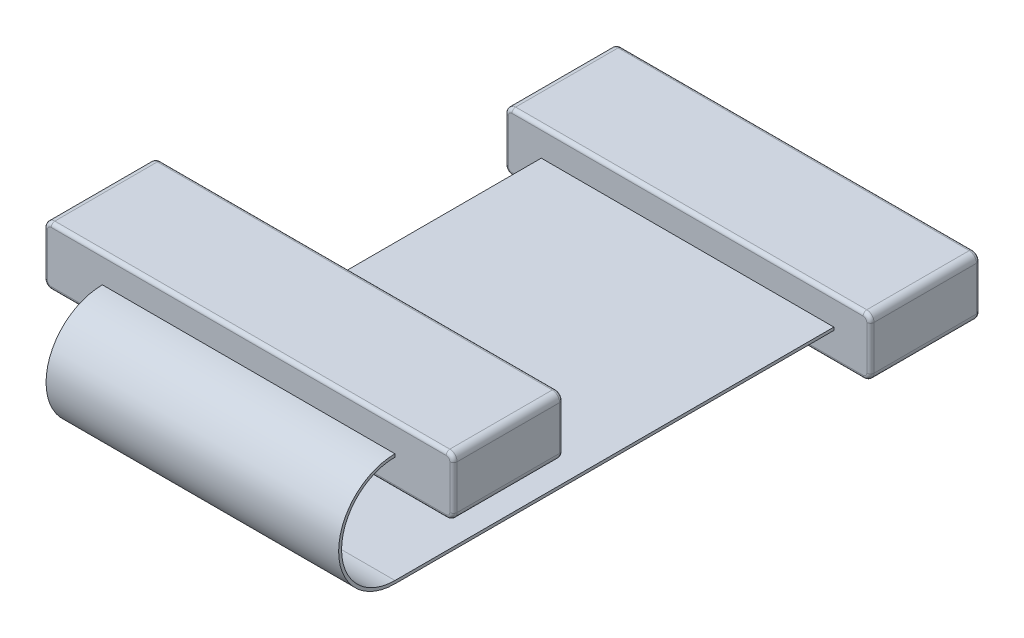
ISO-10303-21;
HEADER;
FILE_DESCRIPTION(('STEP AP214'),'2;1');
FILE_NAME('part.step','',(''),(''),'','','');
FILE_SCHEMA(('AUTOMOTIVE_DESIGN { 1 0 10303 214 1 1 1 1 }'));
ENDSEC;
DATA;
#1=APPLICATION_CONTEXT('core data for automotive mechanical design processes');
#2=APPLICATION_PROTOCOL_DEFINITION('international standard','automotive_design',2000,#1);
#3=PRODUCT_CONTEXT('',#1,'mechanical');
#4=PRODUCT('Part','Part','',(#3));
#5=PRODUCT_RELATED_PRODUCT_CATEGORY('part','',(#4));
#6=PRODUCT_DEFINITION_FORMATION('','',#4);
#7=PRODUCT_DEFINITION_CONTEXT('part definition',#1,'design');
#8=PRODUCT_DEFINITION('design','',#6,#7);
#9=PRODUCT_DEFINITION_SHAPE('','',#8);
#10=(LENGTH_UNIT() NAMED_UNIT(*) SI_UNIT(.MILLI.,.METRE.));
#11=(NAMED_UNIT(*) PLANE_ANGLE_UNIT() SI_UNIT($,.RADIAN.));
#12=(NAMED_UNIT(*) SI_UNIT($,.STERADIAN.) SOLID_ANGLE_UNIT());
#13=UNCERTAINTY_MEASURE_WITH_UNIT(LENGTH_MEASURE(1.E-05),#10,'distance_accuracy_value','');
#14=(GEOMETRIC_REPRESENTATION_CONTEXT(3) GLOBAL_UNCERTAINTY_ASSIGNED_CONTEXT((#13)) GLOBAL_UNIT_ASSIGNED_CONTEXT((#10,
#11,#12)) REPRESENTATION_CONTEXT('',''));
#15=CARTESIAN_POINT('',(0.,0.,0.));
#16=DIRECTION('',(0.,0.,1.));
#17=DIRECTION('',(1.,0.,0.));
#18=AXIS2_PLACEMENT_3D('',#15,#16,#17);
#19=CARTESIAN_POINT('',(-28.,4.,0.));
#20=DIRECTION('',(0.,0.,1.));
#21=DIRECTION('',(1.,0.,0.));
#22=AXIS2_PLACEMENT_3D('',#19,#20,#21);
#23=PLANE('',#22);
#24=CARTESIAN_POINT('',(27.,-3.,0.));
#25=DIRECTION('',(0.,0.,1.));
#26=DIRECTION('',(1.,0.,0.));
#27=AXIS2_PLACEMENT_3D('',#24,#25,#26);
#28=CIRCLE('',#27,0.5);
#29=CARTESIAN_POINT('',(27.5,-3.,0.));
#30=VERTEX_POINT('',#29);
#31=CARTESIAN_POINT('',(27.,-3.5,0.));
#32=VERTEX_POINT('',#31);
#33=EDGE_CURVE('E565',#30,#32,#28,.F.);
#34=ORIENTED_EDGE('',*,*,#33,.T.);
#35=DIRECTION('',(-1.,0.,0.));
#36=VECTOR('',#35,1.);
#37=CARTESIAN_POINT('',(-26.9999999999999,-3.5,0.));
#38=LINE('',#37,#36);
#39=CARTESIAN_POINT('',(-26.9999999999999,-3.5,0.));
#40=VERTEX_POINT('',#39);
#41=EDGE_CURVE('E569',#32,#40,#38,.T.);
#42=ORIENTED_EDGE('',*,*,#41,.T.);
#43=CARTESIAN_POINT('',(-26.9999999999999,-3.,0.));
#44=DIRECTION('',(0.,0.,1.));
#45=DIRECTION('',(1.,0.,0.));
#46=AXIS2_PLACEMENT_3D('',#43,#44,#45);
#47=CIRCLE('',#46,0.5);
#48=CARTESIAN_POINT('',(-27.4999999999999,-3.,0.));
#49=VERTEX_POINT('',#48);
#50=EDGE_CURVE('E567',#40,#49,#47,.F.);
#51=ORIENTED_EDGE('',*,*,#50,.T.);
#52=DIRECTION('',(0.,-1.,0.));
#53=VECTOR('',#52,1.);
#54=CARTESIAN_POINT('',(-27.5,4.,0.));
#55=LINE('',#54,#53);
#56=CARTESIAN_POINT('',(-27.5,3.,0.));
#57=VERTEX_POINT('',#56);
#58=EDGE_CURVE('E563',#49,#57,#55,.F.);
#59=ORIENTED_EDGE('',*,*,#58,.T.);
#60=CARTESIAN_POINT('',(-27.,3.,0.));
#61=DIRECTION('',(0.,0.,1.));
#62=DIRECTION('',(1.,0.,0.));
#63=AXIS2_PLACEMENT_3D('',#60,#61,#62);
#64=CIRCLE('',#63,0.5);
#65=CARTESIAN_POINT('',(-27.,3.5,0.));
#66=VERTEX_POINT('',#65);
#67=EDGE_CURVE('E559',#57,#66,#64,.F.);
#68=ORIENTED_EDGE('',*,*,#67,.T.);
#69=DIRECTION('',(1.,0.,0.));
#70=VECTOR('',#69,1.);
#71=CARTESIAN_POINT('',(27.,3.5,0.));
#72=LINE('',#71,#70);
#73=CARTESIAN_POINT('',(27.,3.5,0.));
#74=VERTEX_POINT('',#73);
#75=EDGE_CURVE('E555',#66,#74,#72,.T.);
#76=ORIENTED_EDGE('',*,*,#75,.T.);
#77=CARTESIAN_POINT('',(27.,3.,0.));
#78=DIRECTION('',(0.,0.,1.));
#79=DIRECTION('',(1.,0.,0.));
#80=AXIS2_PLACEMENT_3D('',#77,#78,#79);
#81=CIRCLE('',#80,0.5);
#82=CARTESIAN_POINT('',(27.5,3.,0.));
#83=VERTEX_POINT('',#82);
#84=EDGE_CURVE('E557',#74,#83,#81,.F.);
#85=ORIENTED_EDGE('',*,*,#84,.T.);
#86=DIRECTION('',(0.,1.,0.));
#87=VECTOR('',#86,1.);
#88=CARTESIAN_POINT('',(27.5,4.,0.));
#89=LINE('',#88,#87);
#90=EDGE_CURVE('E561',#83,#30,#89,.F.);
#91=ORIENTED_EDGE('',*,*,#90,.T.);
#92=EDGE_LOOP('',(#34,#42,#51,#59,#68,#76,#85,#91));
#93=FACE_BOUND('',#92,.T.);
#94=DIRECTION('',(1.,0.,0.));
#95=VECTOR('',#94,1.);
#96=CARTESIAN_POINT('',(-28.,-2.00000000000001,0.));
#97=LINE('',#96,#95);
#98=CARTESIAN_POINT('',(-26.,-2.00000000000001,0.));
#99=VERTEX_POINT('',#98);
#100=CARTESIAN_POINT('',(26.0000000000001,-2.00000000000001,0.));
#101=VERTEX_POINT('',#100);
#102=EDGE_CURVE('E482',#99,#101,#97,.T.);
#103=ORIENTED_EDGE('',*,*,#102,.T.);
#104=DIRECTION('',(0.,1.,0.));
#105=VECTOR('',#104,1.);
#106=CARTESIAN_POINT('',(26.0000000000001,1.5,0.));
#107=LINE('',#106,#105);
#108=CARTESIAN_POINT('',(26.0000000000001,2.00000000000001,0.));
#109=VERTEX_POINT('',#108);
#110=EDGE_CURVE('E485',#101,#109,#107,.T.);
#111=ORIENTED_EDGE('',*,*,#110,.T.);
#112=DIRECTION('',(-1.,0.,0.));
#113=VECTOR('',#112,1.);
#114=CARTESIAN_POINT('',(-28.,2.00000000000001,0.));
#115=LINE('',#114,#113);
#116=CARTESIAN_POINT('',(-26.,2.00000000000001,0.));
#117=VERTEX_POINT('',#116);
#118=EDGE_CURVE('E480',#109,#117,#115,.T.);
#119=ORIENTED_EDGE('',*,*,#118,.T.);
#120=DIRECTION('',(0.,-1.,0.));
#121=VECTOR('',#120,1.);
#122=CARTESIAN_POINT('',(-26.,-1.5,0.));
#123=LINE('',#122,#121);
#124=EDGE_CURVE('E478',#117,#99,#123,.T.);
#125=ORIENTED_EDGE('',*,*,#124,.T.);
#126=EDGE_LOOP('',(#103,#111,#119,#125));
#127=FACE_BOUND('',#126,.T.);
#128=ADVANCED_FACE('F41',(#93,#127),#23,.F.);
#129=CARTESIAN_POINT('',(-28.,4.,15.));
#130=DIRECTION('',(1.,0.,0.));
#131=DIRECTION('',(0.,1.,0.));
#132=AXIS2_PLACEMENT_3D('',#129,#130,#131);
#133=PLANE('',#132);
#134=DIRECTION('',(0.,0.,-1.));
#135=VECTOR('',#134,1.);
#136=CARTESIAN_POINT('',(-28.,3.,0.));
#137=LINE('',#136,#135);
#138=CARTESIAN_POINT('',(-28.,3.,14.5));
#139=VERTEX_POINT('',#138);
#140=CARTESIAN_POINT('',(-28.,3.,0.5));
#141=VERTEX_POINT('',#140);
#142=EDGE_CURVE('E527',#139,#141,#137,.T.);
#143=ORIENTED_EDGE('',*,*,#142,.T.);
#144=DIRECTION('',(0.,-1.,0.));
#145=VECTOR('',#144,1.);
#146=CARTESIAN_POINT('',(-28.,4.,0.5));
#147=LINE('',#146,#145);
#148=CARTESIAN_POINT('',(-27.9999999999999,-3.,0.5));
#149=VERTEX_POINT('',#148);
#150=EDGE_CURVE('E653',#141,#149,#147,.T.);
#151=ORIENTED_EDGE('',*,*,#150,.T.);
#152=DIRECTION('',(0.,0.,-1.));
#153=VECTOR('',#152,1.);
#154=CARTESIAN_POINT('',(-27.9999999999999,-3.,15.));
#155=LINE('',#154,#153);
#156=CARTESIAN_POINT('',(-27.9999999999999,-3.,14.5));
#157=VERTEX_POINT('',#156);
#158=EDGE_CURVE('E530',#149,#157,#155,.F.);
#159=ORIENTED_EDGE('',*,*,#158,.T.);
#160=DIRECTION('',(0.,-1.,0.));
#161=VECTOR('',#160,1.);
#162=CARTESIAN_POINT('',(-28.,3.,14.5));
#163=LINE('',#162,#161);
#164=EDGE_CURVE('E651',#157,#139,#163,.F.);
#165=ORIENTED_EDGE('',*,*,#164,.T.);
#166=EDGE_LOOP('',(#143,#151,#159,#165));
#167=FACE_BOUND('',#166,.T.);
#168=ADVANCED_FACE('F43',(#167),#133,.F.);
#169=CARTESIAN_POINT('',(28.,-4.,15.));
#170=DIRECTION('',(0.,-1.,0.));
#171=DIRECTION('',(1.,0.,0.));
#172=AXIS2_PLACEMENT_3D('',#169,#170,#171);
#173=PLANE('',#172);
#174=DIRECTION('',(0.,0.,-1.));
#175=VECTOR('',#174,1.);
#176=CARTESIAN_POINT('',(-26.9999999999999,-4.,0.));
#177=LINE('',#176,#175);
#178=CARTESIAN_POINT('',(-26.9999999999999,-4.,14.5));
#179=VERTEX_POINT('',#178);
#180=CARTESIAN_POINT('',(-26.9999999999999,-4.,0.5));
#181=VERTEX_POINT('',#180);
#182=EDGE_CURVE('E521',#179,#181,#177,.T.);
#183=ORIENTED_EDGE('',*,*,#182,.T.);
#184=DIRECTION('',(-1.,0.,0.));
#185=VECTOR('',#184,1.);
#186=CARTESIAN_POINT('',(27.,-4.,0.5));
#187=LINE('',#186,#185);
#188=CARTESIAN_POINT('',(27.,-4.,0.5));
#189=VERTEX_POINT('',#188);
#190=EDGE_CURVE('E575',#181,#189,#187,.F.);
#191=ORIENTED_EDGE('',*,*,#190,.T.);
#192=DIRECTION('',(0.,0.,-1.));
#193=VECTOR('',#192,1.);
#194=CARTESIAN_POINT('',(27.,-4.,15.));
#195=LINE('',#194,#193);
#196=CARTESIAN_POINT('',(27.,-4.,14.5));
#197=VERTEX_POINT('',#196);
#198=EDGE_CURVE('E524',#189,#197,#195,.F.);
#199=ORIENTED_EDGE('',*,*,#198,.T.);
#200=DIRECTION('',(-1.,0.,0.));
#201=VECTOR('',#200,1.);
#202=CARTESIAN_POINT('',(28.,-4.,14.5));
#203=LINE('',#202,#201);
#204=EDGE_CURVE('E572',#197,#179,#203,.T.);
#205=ORIENTED_EDGE('',*,*,#204,.T.);
#206=EDGE_LOOP('',(#183,#191,#199,#205));
#207=FACE_BOUND('',#206,.T.);
#208=ADVANCED_FACE('F740',(#207),#173,.T.);
#209=CARTESIAN_POINT('',(28.,-4.,15.));
#210=DIRECTION('',(-1.,0.,0.));
#211=DIRECTION('',(0.,0.,1.));
#212=AXIS2_PLACEMENT_3D('',#209,#210,#211);
#213=PLANE('',#212);
#214=DIRECTION('',(0.,0.,-1.));
#215=VECTOR('',#214,1.);
#216=CARTESIAN_POINT('',(28.,-3.,0.));
#217=LINE('',#216,#215);
#218=CARTESIAN_POINT('',(28.,-3.,14.5));
#219=VERTEX_POINT('',#218);
#220=CARTESIAN_POINT('',(28.,-3.,0.5));
#221=VERTEX_POINT('',#220);
#222=EDGE_CURVE('E515',#219,#221,#217,.T.);
#223=ORIENTED_EDGE('',*,*,#222,.T.);
#224=DIRECTION('',(0.,1.,0.));
#225=VECTOR('',#224,1.);
#226=CARTESIAN_POINT('',(28.,-4.,0.5));
#227=LINE('',#226,#225);
#228=CARTESIAN_POINT('',(28.,3.,0.5));
#229=VERTEX_POINT('',#228);
#230=EDGE_CURVE('E657',#221,#229,#227,.T.);
#231=ORIENTED_EDGE('',*,*,#230,.T.);
#232=DIRECTION('',(0.,0.,-1.));
#233=VECTOR('',#232,1.);
#234=CARTESIAN_POINT('',(28.,3.,15.));
#235=LINE('',#234,#233);
#236=CARTESIAN_POINT('',(28.,3.,14.5));
#237=VERTEX_POINT('',#236);
#238=EDGE_CURVE('E518',#229,#237,#235,.F.);
#239=ORIENTED_EDGE('',*,*,#238,.T.);
#240=DIRECTION('',(0.,1.,0.));
#241=VECTOR('',#240,1.);
#242=CARTESIAN_POINT('',(28.,-3.,14.5));
#243=LINE('',#242,#241);
#244=EDGE_CURVE('E655',#237,#219,#243,.F.);
#245=ORIENTED_EDGE('',*,*,#244,.T.);
#246=EDGE_LOOP('',(#223,#231,#239,#245));
#247=FACE_BOUND('',#246,.T.);
#248=ADVANCED_FACE('F843',(#247),#213,.F.);
#249=CARTESIAN_POINT('',(-28.,4.,15.));
#250=DIRECTION('',(0.,1.,0.));
#251=DIRECTION('',(0.,0.,1.));
#252=AXIS2_PLACEMENT_3D('',#249,#250,#251);
#253=PLANE('',#252);
#254=DIRECTION('',(0.,0.,-1.));
#255=VECTOR('',#254,1.);
#256=CARTESIAN_POINT('',(27.,4.,0.));
#257=LINE('',#256,#255);
#258=CARTESIAN_POINT('',(27.,4.,14.5));
#259=VERTEX_POINT('',#258);
#260=CARTESIAN_POINT('',(27.,4.,0.5));
#261=VERTEX_POINT('',#260);
#262=EDGE_CURVE('E512',#259,#261,#257,.T.);
#263=ORIENTED_EDGE('',*,*,#262,.T.);
#264=DIRECTION('',(1.,0.,0.));
#265=VECTOR('',#264,1.);
#266=CARTESIAN_POINT('',(-27.,4.,0.5));
#267=LINE('',#266,#265);
#268=CARTESIAN_POINT('',(-27.,4.,0.5));
#269=VERTEX_POINT('',#268);
#270=EDGE_CURVE('E684',#261,#269,#267,.F.);
#271=ORIENTED_EDGE('',*,*,#270,.T.);
#272=DIRECTION('',(0.,0.,-1.));
#273=VECTOR('',#272,1.);
#274=CARTESIAN_POINT('',(-27.,4.,15.));
#275=LINE('',#274,#273);
#276=CARTESIAN_POINT('',(-27.,4.,14.5));
#277=VERTEX_POINT('',#276);
#278=EDGE_CURVE('E509',#269,#277,#275,.F.);
#279=ORIENTED_EDGE('',*,*,#278,.T.);
#280=DIRECTION('',(1.,0.,0.));
#281=VECTOR('',#280,1.);
#282=CARTESIAN_POINT('',(-28.,4.,14.5));
#283=LINE('',#282,#281);
#284=EDGE_CURVE('E682',#277,#259,#283,.T.);
#285=ORIENTED_EDGE('',*,*,#284,.T.);
#286=EDGE_LOOP('',(#263,#271,#279,#285));
#287=FACE_BOUND('',#286,.T.);
#288=ADVANCED_FACE('F688',(#287),#253,.T.);
#289=CARTESIAN_POINT('',(-28.,4.,15.));
#290=DIRECTION('',(0.,0.,1.));
#291=DIRECTION('',(1.,0.,0.));
#292=AXIS2_PLACEMENT_3D('',#289,#290,#291);
#293=PLANE('',#292);
#294=CARTESIAN_POINT('',(-26.9999999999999,-3.,15.));
#295=DIRECTION('',(0.,0.,1.));
#296=DIRECTION('',(1.,0.,0.));
#297=AXIS2_PLACEMENT_3D('',#294,#295,#296);
#298=CIRCLE('',#297,0.5);
#299=CARTESIAN_POINT('',(-27.4999999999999,-3.,15.));
#300=VERTEX_POINT('',#299);
#301=CARTESIAN_POINT('',(-26.9999999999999,-3.5,15.));
#302=VERTEX_POINT('',#301);
#303=EDGE_CURVE('E590',#300,#302,#298,.T.);
#304=ORIENTED_EDGE('',*,*,#303,.T.);
#305=DIRECTION('',(-1.,0.,0.));
#306=VECTOR('',#305,1.);
#307=CARTESIAN_POINT('',(-28.,-3.5,15.));
#308=LINE('',#307,#306);
#309=CARTESIAN_POINT('',(27.,-3.5,15.));
#310=VERTEX_POINT('',#309);
#311=EDGE_CURVE('E592',#302,#310,#308,.F.);
#312=ORIENTED_EDGE('',*,*,#311,.T.);
#313=CARTESIAN_POINT('',(27.,-3.,15.));
#314=DIRECTION('',(0.,0.,1.));
#315=DIRECTION('',(1.,0.,0.));
#316=AXIS2_PLACEMENT_3D('',#313,#314,#315);
#317=CIRCLE('',#316,0.5);
#318=CARTESIAN_POINT('',(27.5,-3.,15.));
#319=VERTEX_POINT('',#318);
#320=EDGE_CURVE('E588',#310,#319,#317,.T.);
#321=ORIENTED_EDGE('',*,*,#320,.T.);
#322=DIRECTION('',(0.,1.,0.));
#323=VECTOR('',#322,1.);
#324=CARTESIAN_POINT('',(27.5,3.,15.));
#325=LINE('',#324,#323);
#326=CARTESIAN_POINT('',(27.5,3.,15.));
#327=VERTEX_POINT('',#326);
#328=EDGE_CURVE('E584',#319,#327,#325,.T.);
#329=ORIENTED_EDGE('',*,*,#328,.T.);
#330=CARTESIAN_POINT('',(27.,3.,15.));
#331=DIRECTION('',(0.,0.,1.));
#332=DIRECTION('',(1.,0.,0.));
#333=AXIS2_PLACEMENT_3D('',#330,#331,#332);
#334=CIRCLE('',#333,0.5);
#335=CARTESIAN_POINT('',(27.,3.5,15.));
#336=VERTEX_POINT('',#335);
#337=EDGE_CURVE('E580',#327,#336,#334,.T.);
#338=ORIENTED_EDGE('',*,*,#337,.T.);
#339=DIRECTION('',(1.,0.,0.));
#340=VECTOR('',#339,1.);
#341=CARTESIAN_POINT('',(-28.,3.5,15.));
#342=LINE('',#341,#340);
#343=CARTESIAN_POINT('',(-27.,3.5,15.));
#344=VERTEX_POINT('',#343);
#345=EDGE_CURVE('E578',#336,#344,#342,.F.);
#346=ORIENTED_EDGE('',*,*,#345,.T.);
#347=CARTESIAN_POINT('',(-27.,3.,15.));
#348=DIRECTION('',(0.,0.,1.));
#349=DIRECTION('',(1.,0.,0.));
#350=AXIS2_PLACEMENT_3D('',#347,#348,#349);
#351=CIRCLE('',#350,0.5);
#352=CARTESIAN_POINT('',(-27.5,3.,15.));
#353=VERTEX_POINT('',#352);
#354=EDGE_CURVE('E582',#344,#353,#351,.T.);
#355=ORIENTED_EDGE('',*,*,#354,.T.);
#356=DIRECTION('',(0.,-1.,0.));
#357=VECTOR('',#356,1.);
#358=CARTESIAN_POINT('',(-27.4999999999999,-3.,15.));
#359=LINE('',#358,#357);
#360=EDGE_CURVE('E586',#353,#300,#359,.T.);
#361=ORIENTED_EDGE('',*,*,#360,.T.);
#362=EDGE_LOOP('',(#304,#312,#321,#329,#338,#346,#355,#361));
#363=FACE_BOUND('',#362,.T.);
#364=DIRECTION('',(-1.,0.,0.));
#365=VECTOR('',#364,1.);
#366=CARTESIAN_POINT('',(0.,-0.199999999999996,15.));
#367=LINE('',#366,#365);
#368=CARTESIAN_POINT('',(20.,-0.199999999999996,15.));
#369=VERTEX_POINT('',#368);
#370=CARTESIAN_POINT('',(-20.,-0.199999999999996,15.));
#371=VERTEX_POINT('',#370);
#372=EDGE_CURVE('E424',#369,#371,#367,.T.);
#373=ORIENTED_EDGE('',*,*,#372,.T.);
#374=DIRECTION('',(0.,-1.,0.));
#375=VECTOR('',#374,1.);
#376=CARTESIAN_POINT('',(-20.,0.,15.));
#377=LINE('',#376,#375);
#378=CARTESIAN_POINT('',(-20.,0.200000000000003,15.));
#379=VERTEX_POINT('',#378);
#380=EDGE_CURVE('E437',#379,#371,#377,.T.);
#381=ORIENTED_EDGE('',*,*,#380,.F.);
#382=DIRECTION('',(-1.,0.,0.));
#383=VECTOR('',#382,1.);
#384=CARTESIAN_POINT('',(0.,0.200000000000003,15.));
#385=LINE('',#384,#383);
#386=CARTESIAN_POINT('',(20.,0.200000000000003,15.));
#387=VERTEX_POINT('',#386);
#388=EDGE_CURVE('E406',#387,#379,#385,.T.);
#389=ORIENTED_EDGE('',*,*,#388,.F.);
#390=DIRECTION('',(0.,-1.,0.));
#391=VECTOR('',#390,1.);
#392=CARTESIAN_POINT('',(20.,0.,15.));
#393=LINE('',#392,#391);
#394=EDGE_CURVE('E434',#387,#369,#393,.T.);
#395=ORIENTED_EDGE('',*,*,#394,.T.);
#396=EDGE_LOOP('',(#373,#381,#389,#395));
#397=FACE_BOUND('',#396,.T.);
#398=ADVANCED_FACE('F837',(#363,#397),#293,.T.);
#399=CARTESIAN_POINT('',(-25.5,1.5,10.));
#400=DIRECTION('',(1.,0.,0.));
#401=DIRECTION('',(0.,1.,0.));
#402=AXIS2_PLACEMENT_3D('',#399,#400,#401);
#403=PLANE('',#402);
#404=DIRECTION('',(0.,0.,-1.));
#405=VECTOR('',#404,1.);
#406=CARTESIAN_POINT('',(-25.5,-1.5,10.));
#407=LINE('',#406,#405);
#408=CARTESIAN_POINT('',(-25.5,-1.5,10.));
#409=VERTEX_POINT('',#408);
#410=CARTESIAN_POINT('',(-25.5,-1.5,0.500000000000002));
#411=VERTEX_POINT('',#410);
#412=EDGE_CURVE('E472',#409,#411,#407,.T.);
#413=ORIENTED_EDGE('',*,*,#412,.T.);
#414=DIRECTION('',(0.,1.,0.));
#415=VECTOR('',#414,1.);
#416=CARTESIAN_POINT('',(-25.5,1.5,0.500000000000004));
#417=LINE('',#416,#415);
#418=CARTESIAN_POINT('',(-25.5,1.5,0.500000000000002));
#419=VERTEX_POINT('',#418);
#420=EDGE_CURVE('E491',#411,#419,#417,.T.);
#421=ORIENTED_EDGE('',*,*,#420,.T.);
#422=DIRECTION('',(0.,0.,-1.));
#423=VECTOR('',#422,1.);
#424=CARTESIAN_POINT('',(-25.5,1.5,10.));
#425=LINE('',#424,#423);
#426=CARTESIAN_POINT('',(-25.5,1.5,10.));
#427=VERTEX_POINT('',#426);
#428=EDGE_CURVE('E463',#427,#419,#425,.T.);
#429=ORIENTED_EDGE('',*,*,#428,.F.);
#430=DIRECTION('',(0.,-1.,0.));
#431=VECTOR('',#430,1.);
#432=CARTESIAN_POINT('',(-25.5,1.5,10.));
#433=LINE('',#432,#431);
#434=EDGE_CURVE('E453',#427,#409,#433,.T.);
#435=ORIENTED_EDGE('',*,*,#434,.T.);
#436=EDGE_LOOP('',(#413,#421,#429,#435));
#437=FACE_BOUND('',#436,.T.);
#438=ADVANCED_FACE('F835',(#437),#403,.T.);
#439=CARTESIAN_POINT('',(25.5,-1.5,10.));
#440=DIRECTION('',(0.,-1.,0.));
#441=DIRECTION('',(1.,0.,0.));
#442=AXIS2_PLACEMENT_3D('',#439,#440,#441);
#443=PLANE('',#442);
#444=DIRECTION('',(0.,0.,-1.));
#445=VECTOR('',#444,1.);
#446=CARTESIAN_POINT('',(25.5,-1.5,10.));
#447=LINE('',#446,#445);
#448=CARTESIAN_POINT('',(25.5,-1.5,10.));
#449=VERTEX_POINT('',#448);
#450=CARTESIAN_POINT('',(25.5,-1.5,0.500000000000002));
#451=VERTEX_POINT('',#450);
#452=EDGE_CURVE('E469',#449,#451,#447,.T.);
#453=ORIENTED_EDGE('',*,*,#452,.T.);
#454=DIRECTION('',(-1.,0.,0.));
#455=VECTOR('',#454,1.);
#456=CARTESIAN_POINT('',(25.5,-1.5,0.500000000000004));
#457=LINE('',#456,#455);
#458=EDGE_CURVE('E475',#451,#411,#457,.T.);
#459=ORIENTED_EDGE('',*,*,#458,.T.);
#460=ORIENTED_EDGE('',*,*,#412,.F.);
#461=DIRECTION('',(-1.,0.,0.));
#462=VECTOR('',#461,1.);
#463=CARTESIAN_POINT('',(25.5,-1.5,10.));
#464=LINE('',#463,#462);
#465=EDGE_CURVE('E455',#449,#409,#464,.T.);
#466=ORIENTED_EDGE('',*,*,#465,.F.);
#467=EDGE_LOOP('',(#453,#459,#460,#466));
#468=FACE_BOUND('',#467,.T.);
#469=ADVANCED_FACE('F869',(#468),#443,.F.);
#470=CARTESIAN_POINT('',(25.5,-1.5,10.));
#471=DIRECTION('',(-1.,0.,0.));
#472=DIRECTION('',(0.,0.,1.));
#473=AXIS2_PLACEMENT_3D('',#470,#471,#472);
#474=PLANE('',#473);
#475=DIRECTION('',(0.,0.,-1.));
#476=VECTOR('',#475,1.);
#477=CARTESIAN_POINT('',(25.5,1.5,10.));
#478=LINE('',#477,#476);
#479=CARTESIAN_POINT('',(25.5,1.5,10.));
#480=VERTEX_POINT('',#479);
#481=CARTESIAN_POINT('',(25.5,1.5,0.500000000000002));
#482=VERTEX_POINT('',#481);
#483=EDGE_CURVE('E466',#480,#482,#478,.T.);
#484=ORIENTED_EDGE('',*,*,#483,.T.);
#485=DIRECTION('',(0.,-1.,0.));
#486=VECTOR('',#485,1.);
#487=CARTESIAN_POINT('',(25.5,-1.5,0.500000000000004));
#488=LINE('',#487,#486);
#489=EDGE_CURVE('E489',#482,#451,#488,.T.);
#490=ORIENTED_EDGE('',*,*,#489,.T.);
#491=ORIENTED_EDGE('',*,*,#452,.F.);
#492=DIRECTION('',(0.,1.,0.));
#493=VECTOR('',#492,1.);
#494=CARTESIAN_POINT('',(25.5,-1.5,10.));
#495=LINE('',#494,#493);
#496=EDGE_CURVE('E458',#449,#480,#495,.T.);
#497=ORIENTED_EDGE('',*,*,#496,.T.);
#498=EDGE_LOOP('',(#484,#490,#491,#497));
#499=FACE_BOUND('',#498,.T.);
#500=ADVANCED_FACE('F876',(#499),#474,.T.);
#501=CARTESIAN_POINT('',(-25.5,1.5,10.));
#502=DIRECTION('',(0.,1.,0.));
#503=DIRECTION('',(0.,0.,1.));
#504=AXIS2_PLACEMENT_3D('',#501,#502,#503);
#505=PLANE('',#504);
#506=ORIENTED_EDGE('',*,*,#428,.T.);
#507=DIRECTION('',(1.,0.,0.));
#508=VECTOR('',#507,1.);
#509=CARTESIAN_POINT('',(-25.5,1.5,0.500000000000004));
#510=LINE('',#509,#508);
#511=EDGE_CURVE('E487',#419,#482,#510,.T.);
#512=ORIENTED_EDGE('',*,*,#511,.T.);
#513=ORIENTED_EDGE('',*,*,#483,.F.);
#514=DIRECTION('',(1.,0.,0.));
#515=VECTOR('',#514,1.);
#516=CARTESIAN_POINT('',(-25.5,1.5,10.));
#517=LINE('',#516,#515);
#518=EDGE_CURVE('E460',#427,#480,#517,.T.);
#519=ORIENTED_EDGE('',*,*,#518,.F.);
#520=EDGE_LOOP('',(#506,#512,#513,#519));
#521=FACE_BOUND('',#520,.T.);
#522=ADVANCED_FACE('F883',(#521),#505,.F.);
#523=CARTESIAN_POINT('',(-25.5,1.5,10.));
#524=DIRECTION('',(0.,0.,1.));
#525=DIRECTION('',(1.,0.,0.));
#526=AXIS2_PLACEMENT_3D('',#523,#524,#525);
#527=PLANE('',#526);
#528=ORIENTED_EDGE('',*,*,#434,.F.);
#529=ORIENTED_EDGE('',*,*,#518,.T.);
#530=ORIENTED_EDGE('',*,*,#496,.F.);
#531=ORIENTED_EDGE('',*,*,#465,.T.);
#532=EDGE_LOOP('',(#528,#529,#530,#531));
#533=FACE_BOUND('',#532,.T.);
#534=ADVANCED_FACE('F891',(#533),#527,.F.);
#535=CARTESIAN_POINT('',(-25.5,1.5,0.500000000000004));
#536=DIRECTION('',(0.,0.707106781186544,0.707106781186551));
#537=DIRECTION('',(0.,-0.707106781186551,0.707106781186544));
#538=AXIS2_PLACEMENT_3D('',#535,#536,#537);
#539=PLANE('',#538);
#540=DIRECTION('',(-0.577350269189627,0.577350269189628,-0.577350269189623));
#541=VECTOR('',#540,1.);
#542=CARTESIAN_POINT('',(-25.5,1.5,0.500000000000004));
#543=LINE('',#542,#541);
#544=EDGE_CURVE('E447',#117,#419,#543,.F.);
#545=ORIENTED_EDGE('',*,*,#544,.F.);
#546=ORIENTED_EDGE('',*,*,#118,.F.);
#547=DIRECTION('',(-0.577350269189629,-0.577350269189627,0.577350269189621));
#548=VECTOR('',#547,1.);
#549=CARTESIAN_POINT('',(8.49999999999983,-15.5000000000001,17.5));
#550=LINE('',#549,#548);
#551=EDGE_CURVE('E450',#482,#109,#550,.F.);
#552=ORIENTED_EDGE('',*,*,#551,.F.);
#553=ORIENTED_EDGE('',*,*,#511,.F.);
#554=EDGE_LOOP('',(#545,#546,#552,#553));
#555=FACE_BOUND('',#554,.T.);
#556=ADVANCED_FACE('F899',(#555),#539,.F.);
#557=CARTESIAN_POINT('',(26.0000000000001,4.,0.));
#558=DIRECTION('',(-0.707106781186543,0.,-0.707106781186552));
#559=DIRECTION('',(-0.707106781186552,0.,0.707106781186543));
#560=AXIS2_PLACEMENT_3D('',#557,#558,#559);
#561=PLANE('',#560);
#562=ORIENTED_EDGE('',*,*,#551,.T.);
#563=ORIENTED_EDGE('',*,*,#110,.F.);
#564=DIRECTION('',(0.577350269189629,-0.577350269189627,-0.577350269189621));
#565=VECTOR('',#564,1.);
#566=CARTESIAN_POINT('',(25.5,-1.5,0.500000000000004));
#567=LINE('',#566,#565);
#568=EDGE_CURVE('E445',#451,#101,#567,.T.);
#569=ORIENTED_EDGE('',*,*,#568,.F.);
#570=ORIENTED_EDGE('',*,*,#489,.F.);
#571=EDGE_LOOP('',(#562,#563,#569,#570));
#572=FACE_BOUND('',#571,.T.);
#573=ADVANCED_FACE('F907',(#572),#561,.T.);
#574=CARTESIAN_POINT('',(-26.,4.00000000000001,0.));
#575=DIRECTION('',(0.707106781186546,0.,-0.707106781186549));
#576=DIRECTION('',(-0.707106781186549,0.,-0.707106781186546));
#577=AXIS2_PLACEMENT_3D('',#574,#575,#576);
#578=PLANE('',#577);
#579=ORIENTED_EDGE('',*,*,#544,.T.);
#580=ORIENTED_EDGE('',*,*,#420,.F.);
#581=DIRECTION('',(0.577350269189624,0.577350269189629,0.577350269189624));
#582=VECTOR('',#581,1.);
#583=CARTESIAN_POINT('',(-8.50000000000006,15.5,17.4999999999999));
#584=LINE('',#583,#582);
#585=EDGE_CURVE('E442',#99,#411,#584,.T.);
#586=ORIENTED_EDGE('',*,*,#585,.F.);
#587=ORIENTED_EDGE('',*,*,#124,.F.);
#588=EDGE_LOOP('',(#579,#580,#586,#587));
#589=FACE_BOUND('',#588,.T.);
#590=ADVANCED_FACE('F915',(#589),#578,.T.);
#591=CARTESIAN_POINT('',(25.5,-1.5,0.500000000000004));
#592=DIRECTION('',(0.,-0.707106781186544,0.707106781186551));
#593=DIRECTION('',(0.,-0.707106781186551,-0.707106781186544));
#594=AXIS2_PLACEMENT_3D('',#591,#592,#593);
#595=PLANE('',#594);
#596=ORIENTED_EDGE('',*,*,#568,.T.);
#597=ORIENTED_EDGE('',*,*,#102,.F.);
#598=ORIENTED_EDGE('',*,*,#585,.T.);
#599=ORIENTED_EDGE('',*,*,#458,.F.);
#600=EDGE_LOOP('',(#596,#597,#598,#599));
#601=FACE_BOUND('',#600,.T.);
#602=ADVANCED_FACE('F923',(#601),#595,.F.);
#603=CARTESIAN_POINT('',(-20.,-7.5,15.));
#604=DIRECTION('',(1.,0.,0.));
#605=DIRECTION('',(0.,0.,-1.));
#606=AXIS2_PLACEMENT_3D('',#603,#604,#605);
#607=PLANE('',#606);
#608=CARTESIAN_POINT('',(-20.,-7.5,15.));
#609=DIRECTION('',(-1.,0.,0.));
#610=DIRECTION('',(0.,0.,1.));
#611=AXIS2_PLACEMENT_3D('',#608,#609,#610);
#612=CIRCLE('',#611,7.3);
#613=CARTESIAN_POINT('',(-20.,-14.8,15.));
#614=VERTEX_POINT('',#613);
#615=EDGE_CURVE('E416',#614,#371,#612,.T.);
#616=ORIENTED_EDGE('',*,*,#615,.F.);
#617=DIRECTION('',(0.,0.,1.));
#618=VECTOR('',#617,1.);
#619=CARTESIAN_POINT('',(-20.,-14.8,15.));
#620=LINE('',#619,#618);
#621=CARTESIAN_POINT('',(-20.,-14.8,-45.));
#622=VERTEX_POINT('',#621);
#623=EDGE_CURVE('E429',#614,#622,#620,.F.);
#624=ORIENTED_EDGE('',*,*,#623,.T.);
#625=DIRECTION('',(0.,1.,0.));
#626=VECTOR('',#625,1.);
#627=CARTESIAN_POINT('',(-20.,-15.,-45.));
#628=LINE('',#627,#626);
#629=CARTESIAN_POINT('',(-20.,-15.2,-45.));
#630=VERTEX_POINT('',#629);
#631=EDGE_CURVE('E439',#630,#622,#628,.T.);
#632=ORIENTED_EDGE('',*,*,#631,.F.);
#633=DIRECTION('',(0.,0.,1.));
#634=VECTOR('',#633,1.);
#635=CARTESIAN_POINT('',(-20.,-15.2,15.));
#636=LINE('',#635,#634);
#637=CARTESIAN_POINT('',(-20.,-15.2,15.));
#638=VERTEX_POINT('',#637);
#639=EDGE_CURVE('E410',#638,#630,#636,.F.);
#640=ORIENTED_EDGE('',*,*,#639,.F.);
#641=CARTESIAN_POINT('',(-20.,-7.5,15.));
#642=DIRECTION('',(-1.,0.,0.));
#643=DIRECTION('',(0.,0.,1.));
#644=AXIS2_PLACEMENT_3D('',#641,#642,#643);
#645=CIRCLE('',#644,7.7);
#646=EDGE_CURVE('E399',#638,#379,#645,.T.);
#647=ORIENTED_EDGE('',*,*,#646,.T.);
#648=ORIENTED_EDGE('',*,*,#380,.T.);
#649=EDGE_LOOP('',(#616,#624,#632,#640,#647,#648));
#650=FACE_BOUND('',#649,.T.);
#651=ADVANCED_FACE('F931',(#650),#607,.F.);
#652=CARTESIAN_POINT('',(20.,-15.,15.));
#653=DIRECTION('',(-1.,0.,0.));
#654=DIRECTION('',(0.,0.,-1.));
#655=AXIS2_PLACEMENT_3D('',#652,#653,#654);
#656=PLANE('',#655);
#657=DIRECTION('',(0.,0.,1.));
#658=VECTOR('',#657,1.);
#659=CARTESIAN_POINT('',(20.,-14.8,15.));
#660=LINE('',#659,#658);
#661=CARTESIAN_POINT('',(20.,-14.8,15.));
#662=VERTEX_POINT('',#661);
#663=CARTESIAN_POINT('',(20.,-14.8,-45.));
#664=VERTEX_POINT('',#663);
#665=EDGE_CURVE('E417',#662,#664,#660,.F.);
#666=ORIENTED_EDGE('',*,*,#665,.F.);
#667=CARTESIAN_POINT('',(20.,-7.5,15.));
#668=DIRECTION('',(-1.,0.,0.));
#669=DIRECTION('',(0.,0.,1.));
#670=AXIS2_PLACEMENT_3D('',#667,#668,#669);
#671=CIRCLE('',#670,7.3);
#672=EDGE_CURVE('E421',#662,#369,#671,.T.);
#673=ORIENTED_EDGE('',*,*,#672,.T.);
#674=ORIENTED_EDGE('',*,*,#394,.F.);
#675=CARTESIAN_POINT('',(20.,-7.5,15.));
#676=DIRECTION('',(-1.,0.,0.));
#677=DIRECTION('',(0.,0.,1.));
#678=AXIS2_PLACEMENT_3D('',#675,#676,#677);
#679=CIRCLE('',#678,7.7);
#680=CARTESIAN_POINT('',(20.,-15.2,15.));
#681=VERTEX_POINT('',#680);
#682=EDGE_CURVE('E404',#681,#387,#679,.T.);
#683=ORIENTED_EDGE('',*,*,#682,.F.);
#684=DIRECTION('',(0.,0.,1.));
#685=VECTOR('',#684,1.);
#686=CARTESIAN_POINT('',(20.,-15.2,15.));
#687=LINE('',#686,#685);
#688=CARTESIAN_POINT('',(20.,-15.2,-45.));
#689=VERTEX_POINT('',#688);
#690=EDGE_CURVE('E400',#681,#689,#687,.F.);
#691=ORIENTED_EDGE('',*,*,#690,.T.);
#692=DIRECTION('',(0.,1.,0.));
#693=VECTOR('',#692,1.);
#694=CARTESIAN_POINT('',(20.,-15.,-45.));
#695=LINE('',#694,#693);
#696=EDGE_CURVE('E432',#689,#664,#695,.T.);
#697=ORIENTED_EDGE('',*,*,#696,.T.);
#698=EDGE_LOOP('',(#666,#673,#674,#683,#691,#697));
#699=FACE_BOUND('',#698,.T.);
#700=ADVANCED_FACE('F939',(#699),#656,.F.);
#701=CARTESIAN_POINT('',(20.,-14.8,15.));
#702=DIRECTION('',(0.,-1.,0.));
#703=DIRECTION('',(1.,0.,0.));
#704=AXIS2_PLACEMENT_3D('',#701,#702,#703);
#705=PLANE('',#704);
#706=DIRECTION('',(-1.,0.,0.));
#707=VECTOR('',#706,1.);
#708=CARTESIAN_POINT('',(0.,-14.8,15.));
#709=LINE('',#708,#707);
#710=EDGE_CURVE('E412',#662,#614,#709,.T.);
#711=ORIENTED_EDGE('',*,*,#710,.F.);
#712=ORIENTED_EDGE('',*,*,#665,.T.);
#713=DIRECTION('',(1.,0.,0.));
#714=VECTOR('',#713,1.);
#715=CARTESIAN_POINT('',(20.,-14.8,-45.));
#716=LINE('',#715,#714);
#717=EDGE_CURVE('E420',#664,#622,#716,.F.);
#718=ORIENTED_EDGE('',*,*,#717,.T.);
#719=ORIENTED_EDGE('',*,*,#623,.F.);
#720=EDGE_LOOP('',(#711,#712,#718,#719));
#721=FACE_BOUND('',#720,.T.);
#722=ADVANCED_FACE('F947',(#721),#705,.F.);
#723=CARTESIAN_POINT('',(0.,-7.5,15.));
#724=DIRECTION('',(-1.,0.,0.));
#725=DIRECTION('',(0.,0.,1.));
#726=AXIS2_PLACEMENT_3D('',#723,#724,#725);
#727=CYLINDRICAL_SURFACE('',#726,7.3);
#728=ORIENTED_EDGE('',*,*,#710,.T.);
#729=ORIENTED_EDGE('',*,*,#615,.T.);
#730=ORIENTED_EDGE('',*,*,#372,.F.);
#731=ORIENTED_EDGE('',*,*,#672,.F.);
#732=EDGE_LOOP('',(#728,#729,#730,#731));
#733=FACE_BOUND('',#732,.T.);
#734=ADVANCED_FACE('F950',(#733),#727,.F.);
#735=CARTESIAN_POINT('',(20.,-15.2,15.));
#736=DIRECTION('',(0.,-1.,0.));
#737=DIRECTION('',(1.,0.,0.));
#738=AXIS2_PLACEMENT_3D('',#735,#736,#737);
#739=PLANE('',#738);
#740=DIRECTION('',(-1.,0.,0.));
#741=VECTOR('',#740,1.);
#742=CARTESIAN_POINT('',(0.,-15.2,15.));
#743=LINE('',#742,#741);
#744=EDGE_CURVE('E393',#681,#638,#743,.T.);
#745=ORIENTED_EDGE('',*,*,#744,.T.);
#746=ORIENTED_EDGE('',*,*,#639,.T.);
#747=DIRECTION('',(1.,0.,0.));
#748=VECTOR('',#747,1.);
#749=CARTESIAN_POINT('',(20.,-15.2,-45.));
#750=LINE('',#749,#748);
#751=EDGE_CURVE('E403',#689,#630,#750,.F.);
#752=ORIENTED_EDGE('',*,*,#751,.F.);
#753=ORIENTED_EDGE('',*,*,#690,.F.);
#754=EDGE_LOOP('',(#745,#746,#752,#753));
#755=FACE_BOUND('',#754,.T.);
#756=ADVANCED_FACE('F958',(#755),#739,.T.);
#757=CARTESIAN_POINT('',(0.,-7.5,15.));
#758=DIRECTION('',(-1.,0.,0.));
#759=DIRECTION('',(0.,0.,1.));
#760=AXIS2_PLACEMENT_3D('',#757,#758,#759);
#761=CYLINDRICAL_SURFACE('',#760,7.7);
#762=ORIENTED_EDGE('',*,*,#744,.F.);
#763=ORIENTED_EDGE('',*,*,#682,.T.);
#764=ORIENTED_EDGE('',*,*,#388,.T.);
#765=ORIENTED_EDGE('',*,*,#646,.F.);
#766=EDGE_LOOP('',(#762,#763,#764,#765));
#767=FACE_BOUND('',#766,.T.);
#768=ADVANCED_FACE('F971',(#767),#761,.T.);
#769=CARTESIAN_POINT('',(25.,-19.,-45.));
#770=DIRECTION('',(0.,0.,1.));
#771=DIRECTION('',(1.,0.,0.));
#772=AXIS2_PLACEMENT_3D('',#769,#770,#771);
#773=PLANE('',#772);
#774=CARTESIAN_POINT('',(-24.,-18.,-45.));
#775=DIRECTION('',(0.,0.,1.));
#776=DIRECTION('',(1.,0.,0.));
#777=AXIS2_PLACEMENT_3D('',#774,#775,#776);
#778=CIRCLE('',#777,0.5);
#779=CARTESIAN_POINT('',(-24.5,-18.,-45.));
#780=VERTEX_POINT('',#779);
#781=CARTESIAN_POINT('',(-24.,-18.5,-45.));
#782=VERTEX_POINT('',#781);
#783=EDGE_CURVE('E630',#780,#782,#778,.T.);
#784=ORIENTED_EDGE('',*,*,#783,.T.);
#785=DIRECTION('',(-1.,0.,0.));
#786=VECTOR('',#785,1.);
#787=CARTESIAN_POINT('',(24.,-18.5,-45.));
#788=LINE('',#787,#786);
#789=CARTESIAN_POINT('',(24.,-18.5,-45.));
#790=VERTEX_POINT('',#789);
#791=EDGE_CURVE('E632',#782,#790,#788,.F.);
#792=ORIENTED_EDGE('',*,*,#791,.T.);
#793=CARTESIAN_POINT('',(24.,-18.,-45.));
#794=DIRECTION('',(0.,0.,1.));
#795=DIRECTION('',(1.,0.,0.));
#796=AXIS2_PLACEMENT_3D('',#793,#794,#795);
#797=CIRCLE('',#796,0.5);
#798=CARTESIAN_POINT('',(24.5,-18.,-45.));
#799=VERTEX_POINT('',#798);
#800=EDGE_CURVE('E628',#790,#799,#797,.T.);
#801=ORIENTED_EDGE('',*,*,#800,.T.);
#802=DIRECTION('',(0.,1.,0.));
#803=VECTOR('',#802,1.);
#804=CARTESIAN_POINT('',(24.5,-19.,-45.));
#805=LINE('',#804,#803);
#806=CARTESIAN_POINT('',(24.5,-12.,-45.));
#807=VERTEX_POINT('',#806);
#808=EDGE_CURVE('E624',#799,#807,#805,.T.);
#809=ORIENTED_EDGE('',*,*,#808,.T.);
#810=CARTESIAN_POINT('',(24.,-12.,-45.));
#811=DIRECTION('',(0.,0.,1.));
#812=DIRECTION('',(1.,0.,0.));
#813=AXIS2_PLACEMENT_3D('',#810,#811,#812);
#814=CIRCLE('',#813,0.5);
#815=CARTESIAN_POINT('',(24.,-11.5,-45.));
#816=VERTEX_POINT('',#815);
#817=EDGE_CURVE('E620',#807,#816,#814,.T.);
#818=ORIENTED_EDGE('',*,*,#817,.T.);
#819=DIRECTION('',(1.,0.,0.));
#820=VECTOR('',#819,1.);
#821=CARTESIAN_POINT('',(-24.,-11.5,-45.));
#822=LINE('',#821,#820);
#823=CARTESIAN_POINT('',(-24.,-11.5,-45.));
#824=VERTEX_POINT('',#823);
#825=EDGE_CURVE('E618',#816,#824,#822,.F.);
#826=ORIENTED_EDGE('',*,*,#825,.T.);
#827=CARTESIAN_POINT('',(-24.,-12.,-45.));
#828=DIRECTION('',(0.,0.,1.));
#829=DIRECTION('',(1.,0.,0.));
#830=AXIS2_PLACEMENT_3D('',#827,#828,#829);
#831=CIRCLE('',#830,0.5);
#832=CARTESIAN_POINT('',(-24.5,-12.,-45.));
#833=VERTEX_POINT('',#832);
#834=EDGE_CURVE('E622',#824,#833,#831,.T.);
#835=ORIENTED_EDGE('',*,*,#834,.T.);
#836=DIRECTION('',(0.,-1.,0.));
#837=VECTOR('',#836,1.);
#838=CARTESIAN_POINT('',(-24.5,-19.,-45.));
#839=LINE('',#838,#837);
#840=EDGE_CURVE('E626',#833,#780,#839,.T.);
#841=ORIENTED_EDGE('',*,*,#840,.T.);
#842=EDGE_LOOP('',(#784,#792,#801,#809,#818,#826,#835,#841));
#843=FACE_BOUND('',#842,.T.);
#844=ORIENTED_EDGE('',*,*,#717,.F.);
#845=ORIENTED_EDGE('',*,*,#696,.F.);
#846=ORIENTED_EDGE('',*,*,#751,.T.);
#847=ORIENTED_EDGE('',*,*,#631,.T.);
#848=EDGE_LOOP('',(#844,#845,#846,#847));
#849=FACE_BOUND('',#848,.T.);
#850=ADVANCED_FACE('F979',(#843,#849),#773,.T.);
#851=CARTESIAN_POINT('',(25.,-19.,-60.));
#852=DIRECTION('',(1.,0.,0.));
#853=DIRECTION('',(0.,0.,-1.));
#854=AXIS2_PLACEMENT_3D('',#851,#852,#853);
#855=PLANE('',#854);
#856=DIRECTION('',(0.,0.,1.));
#857=VECTOR('',#856,1.);
#858=CARTESIAN_POINT('',(25.,-18.,-60.));
#859=LINE('',#858,#857);
#860=CARTESIAN_POINT('',(25.,-18.,-45.5));
#861=VERTEX_POINT('',#860);
#862=CARTESIAN_POINT('',(25.,-18.,-59.5));
#863=VERTEX_POINT('',#862);
#864=EDGE_CURVE('E533',#861,#863,#859,.F.);
#865=ORIENTED_EDGE('',*,*,#864,.T.);
#866=DIRECTION('',(0.,1.,0.));
#867=VECTOR('',#866,1.);
#868=CARTESIAN_POINT('',(25.,-12.,-59.5));
#869=LINE('',#868,#867);
#870=CARTESIAN_POINT('',(25.,-12.,-59.5));
#871=VERTEX_POINT('',#870);
#872=EDGE_CURVE('E665',#863,#871,#869,.T.);
#873=ORIENTED_EDGE('',*,*,#872,.T.);
#874=DIRECTION('',(0.,0.,1.));
#875=VECTOR('',#874,1.);
#876=CARTESIAN_POINT('',(25.,-12.,-45.));
#877=LINE('',#876,#875);
#878=CARTESIAN_POINT('',(25.,-12.,-45.5));
#879=VERTEX_POINT('',#878);
#880=EDGE_CURVE('E536',#871,#879,#877,.T.);
#881=ORIENTED_EDGE('',*,*,#880,.T.);
#882=DIRECTION('',(0.,1.,0.));
#883=VECTOR('',#882,1.);
#884=CARTESIAN_POINT('',(25.,-19.,-45.5));
#885=LINE('',#884,#883);
#886=EDGE_CURVE('E663',#879,#861,#885,.F.);
#887=ORIENTED_EDGE('',*,*,#886,.T.);
#888=EDGE_LOOP('',(#865,#873,#881,#887));
#889=FACE_BOUND('',#888,.T.);
#890=ADVANCED_FACE('F987',(#889),#855,.T.);
#891=CARTESIAN_POINT('',(25.,-19.,-60.));
#892=DIRECTION('',(0.,1.,0.));
#893=DIRECTION('',(0.,0.,1.));
#894=AXIS2_PLACEMENT_3D('',#891,#892,#893);
#895=PLANE('',#894);
#896=DIRECTION('',(0.,0.,1.));
#897=VECTOR('',#896,1.);
#898=CARTESIAN_POINT('',(-24.,-19.,-60.));
#899=LINE('',#898,#897);
#900=CARTESIAN_POINT('',(-24.,-19.,-45.5));
#901=VERTEX_POINT('',#900);
#902=CARTESIAN_POINT('',(-24.,-19.,-59.5));
#903=VERTEX_POINT('',#902);
#904=EDGE_CURVE('E543',#901,#903,#899,.F.);
#905=ORIENTED_EDGE('',*,*,#904,.T.);
#906=DIRECTION('',(-1.,0.,0.));
#907=VECTOR('',#906,1.);
#908=CARTESIAN_POINT('',(25.,-19.,-59.5));
#909=LINE('',#908,#907);
#910=CARTESIAN_POINT('',(24.,-19.,-59.5));
#911=VERTEX_POINT('',#910);
#912=EDGE_CURVE('E615',#903,#911,#909,.F.);
#913=ORIENTED_EDGE('',*,*,#912,.T.);
#914=DIRECTION('',(0.,0.,1.));
#915=VECTOR('',#914,1.);
#916=CARTESIAN_POINT('',(24.,-19.,-45.));
#917=LINE('',#916,#915);
#918=CARTESIAN_POINT('',(24.,-19.,-45.5));
#919=VERTEX_POINT('',#918);
#920=EDGE_CURVE('E546',#911,#919,#917,.T.);
#921=ORIENTED_EDGE('',*,*,#920,.T.);
#922=DIRECTION('',(-1.,0.,0.));
#923=VECTOR('',#922,1.);
#924=CARTESIAN_POINT('',(-24.,-19.,-45.5));
#925=LINE('',#924,#923);
#926=EDGE_CURVE('E612',#919,#901,#925,.T.);
#927=ORIENTED_EDGE('',*,*,#926,.T.);
#928=EDGE_LOOP('',(#905,#913,#921,#927));
#929=FACE_BOUND('',#928,.T.);
#930=ADVANCED_FACE('F994',(#929),#895,.F.);
#931=CARTESIAN_POINT('',(-25.,-11.,-60.));
#932=DIRECTION('',(-1.,0.,0.));
#933=DIRECTION('',(0.,0.,1.));
#934=AXIS2_PLACEMENT_3D('',#931,#932,#933);
#935=PLANE('',#934);
#936=DIRECTION('',(0.,0.,1.));
#937=VECTOR('',#936,1.);
#938=CARTESIAN_POINT('',(-25.,-12.,-60.));
#939=LINE('',#938,#937);
#940=CARTESIAN_POINT('',(-25.,-12.,-45.5));
#941=VERTEX_POINT('',#940);
#942=CARTESIAN_POINT('',(-25.,-12.,-59.5));
#943=VERTEX_POINT('',#942);
#944=EDGE_CURVE('E549',#941,#943,#939,.F.);
#945=ORIENTED_EDGE('',*,*,#944,.T.);
#946=DIRECTION('',(0.,-1.,0.));
#947=VECTOR('',#946,1.);
#948=CARTESIAN_POINT('',(-25.,-18.,-59.5));
#949=LINE('',#948,#947);
#950=CARTESIAN_POINT('',(-25.,-18.,-59.5));
#951=VERTEX_POINT('',#950);
#952=EDGE_CURVE('E661',#943,#951,#949,.T.);
#953=ORIENTED_EDGE('',*,*,#952,.T.);
#954=DIRECTION('',(0.,0.,1.));
#955=VECTOR('',#954,1.);
#956=CARTESIAN_POINT('',(-25.,-18.,-45.));
#957=LINE('',#956,#955);
#958=CARTESIAN_POINT('',(-25.,-18.,-45.5));
#959=VERTEX_POINT('',#958);
#960=EDGE_CURVE('E552',#951,#959,#957,.T.);
#961=ORIENTED_EDGE('',*,*,#960,.T.);
#962=DIRECTION('',(0.,-1.,0.));
#963=VECTOR('',#962,1.);
#964=CARTESIAN_POINT('',(-25.,-11.,-45.5));
#965=LINE('',#964,#963);
#966=EDGE_CURVE('E659',#959,#941,#965,.F.);
#967=ORIENTED_EDGE('',*,*,#966,.T.);
#968=EDGE_LOOP('',(#945,#953,#961,#967));
#969=FACE_BOUND('',#968,.T.);
#970=ADVANCED_FACE('F822',(#969),#935,.T.);
#971=CARTESIAN_POINT('',(-25.,-11.,-60.));
#972=DIRECTION('',(0.,-1.,0.));
#973=DIRECTION('',(1.,0.,0.));
#974=AXIS2_PLACEMENT_3D('',#971,#972,#973);
#975=PLANE('',#974);
#976=DIRECTION('',(0.,0.,1.));
#977=VECTOR('',#976,1.);
#978=CARTESIAN_POINT('',(24.,-11.,-60.));
#979=LINE('',#978,#977);
#980=CARTESIAN_POINT('',(24.,-11.,-45.5));
#981=VERTEX_POINT('',#980);
#982=CARTESIAN_POINT('',(24.,-11.,-59.5));
#983=VERTEX_POINT('',#982);
#984=EDGE_CURVE('E541',#981,#983,#979,.F.);
#985=ORIENTED_EDGE('',*,*,#984,.T.);
#986=DIRECTION('',(1.,0.,0.));
#987=VECTOR('',#986,1.);
#988=CARTESIAN_POINT('',(-25.,-11.,-59.5));
#989=LINE('',#988,#987);
#990=CARTESIAN_POINT('',(-24.,-11.,-59.5));
#991=VERTEX_POINT('',#990);
#992=EDGE_CURVE('E12',#983,#991,#989,.F.);
#993=ORIENTED_EDGE('',*,*,#992,.T.);
#994=DIRECTION('',(0.,0.,1.));
#995=VECTOR('',#994,1.);
#996=CARTESIAN_POINT('',(-24.,-11.,-45.));
#997=LINE('',#996,#995);
#998=CARTESIAN_POINT('',(-24.,-11.,-45.5));
#999=VERTEX_POINT('',#998);
#1000=EDGE_CURVE('E539',#991,#999,#997,.T.);
#1001=ORIENTED_EDGE('',*,*,#1000,.T.);
#1002=DIRECTION('',(1.,0.,0.));
#1003=VECTOR('',#1002,1.);
#1004=CARTESIAN_POINT('',(24.,-11.,-45.5));
#1005=LINE('',#1004,#1003);
#1006=EDGE_CURVE('E49',#999,#981,#1005,.T.);
#1007=ORIENTED_EDGE('',*,*,#1006,.T.);
#1008=EDGE_LOOP('',(#985,#993,#1001,#1007));
#1009=FACE_BOUND('',#1008,.T.);
#1010=ADVANCED_FACE('F814',(#1009),#975,.F.);
#1011=CARTESIAN_POINT('',(25.,-19.,-60.));
#1012=DIRECTION('',(0.,0.,1.));
#1013=DIRECTION('',(1.,0.,0.));
#1014=AXIS2_PLACEMENT_3D('',#1011,#1012,#1013);
#1015=PLANE('',#1014);
#1016=CARTESIAN_POINT('',(24.,-18.,-60.));
#1017=DIRECTION('',(0.,0.,1.));
#1018=DIRECTION('',(1.,0.,0.));
#1019=AXIS2_PLACEMENT_3D('',#1016,#1017,#1018);
#1020=CIRCLE('',#1019,0.5);
#1021=CARTESIAN_POINT('',(24.5,-18.,-60.));
#1022=VERTEX_POINT('',#1021);
#1023=CARTESIAN_POINT('',(24.,-18.5,-60.));
#1024=VERTEX_POINT('',#1023);
#1025=EDGE_CURVE('E605',#1022,#1024,#1020,.F.);
#1026=ORIENTED_EDGE('',*,*,#1025,.T.);
#1027=DIRECTION('',(-1.,0.,0.));
#1028=VECTOR('',#1027,1.);
#1029=CARTESIAN_POINT('',(25.,-18.5,-60.));
#1030=LINE('',#1029,#1028);
#1031=CARTESIAN_POINT('',(-24.,-18.5,-60.));
#1032=VERTEX_POINT('',#1031);
#1033=EDGE_CURVE('E609',#1024,#1032,#1030,.T.);
#1034=ORIENTED_EDGE('',*,*,#1033,.T.);
#1035=CARTESIAN_POINT('',(-24.,-18.,-60.));
#1036=DIRECTION('',(0.,0.,1.));
#1037=DIRECTION('',(1.,0.,0.));
#1038=AXIS2_PLACEMENT_3D('',#1035,#1036,#1037);
#1039=CIRCLE('',#1038,0.5);
#1040=CARTESIAN_POINT('',(-24.5,-18.,-60.));
#1041=VERTEX_POINT('',#1040);
#1042=EDGE_CURVE('E607',#1032,#1041,#1039,.F.);
#1043=ORIENTED_EDGE('',*,*,#1042,.T.);
#1044=DIRECTION('',(0.,-1.,0.));
#1045=VECTOR('',#1044,1.);
#1046=CARTESIAN_POINT('',(-24.5,-12.,-60.));
#1047=LINE('',#1046,#1045);
#1048=CARTESIAN_POINT('',(-24.5,-12.,-60.));
#1049=VERTEX_POINT('',#1048);
#1050=EDGE_CURVE('E603',#1041,#1049,#1047,.F.);
#1051=ORIENTED_EDGE('',*,*,#1050,.T.);
#1052=CARTESIAN_POINT('',(-24.,-12.,-60.));
#1053=DIRECTION('',(0.,0.,1.));
#1054=DIRECTION('',(1.,0.,0.));
#1055=AXIS2_PLACEMENT_3D('',#1052,#1053,#1054);
#1056=CIRCLE('',#1055,0.5);
#1057=CARTESIAN_POINT('',(-24.,-11.5,-60.));
#1058=VERTEX_POINT('',#1057);
#1059=EDGE_CURVE('E599',#1049,#1058,#1056,.F.);
#1060=ORIENTED_EDGE('',*,*,#1059,.T.);
#1061=DIRECTION('',(1.,0.,0.));
#1062=VECTOR('',#1061,1.);
#1063=CARTESIAN_POINT('',(25.,-11.5,-60.));
#1064=LINE('',#1063,#1062);
#1065=CARTESIAN_POINT('',(24.,-11.5,-60.));
#1066=VERTEX_POINT('',#1065);
#1067=EDGE_CURVE('E595',#1058,#1066,#1064,.T.);
#1068=ORIENTED_EDGE('',*,*,#1067,.T.);
#1069=CARTESIAN_POINT('',(24.,-12.,-60.));
#1070=DIRECTION('',(0.,0.,1.));
#1071=DIRECTION('',(1.,0.,0.));
#1072=AXIS2_PLACEMENT_3D('',#1069,#1070,#1071);
#1073=CIRCLE('',#1072,0.5);
#1074=CARTESIAN_POINT('',(24.5,-12.,-60.));
#1075=VERTEX_POINT('',#1074);
#1076=EDGE_CURVE('E597',#1066,#1075,#1073,.F.);
#1077=ORIENTED_EDGE('',*,*,#1076,.T.);
#1078=DIRECTION('',(0.,1.,0.));
#1079=VECTOR('',#1078,1.);
#1080=CARTESIAN_POINT('',(24.5,-18.,-60.));
#1081=LINE('',#1080,#1079);
#1082=EDGE_CURVE('E601',#1075,#1022,#1081,.F.);
#1083=ORIENTED_EDGE('',*,*,#1082,.T.);
#1084=EDGE_LOOP('',(#1026,#1034,#1043,#1051,#1060,#1068,#1077,#1083));
#1085=FACE_BOUND('',#1084,.T.);
#1086=DIRECTION('',(1.,0.,0.));
#1087=VECTOR('',#1086,1.);
#1088=CARTESIAN_POINT('',(25.,-17.5,-60.));
#1089=LINE('',#1088,#1087);
#1090=CARTESIAN_POINT('',(-23.5,-17.5,-60.));
#1091=VERTEX_POINT('',#1090);
#1092=CARTESIAN_POINT('',(23.5,-17.5,-60.));
#1093=VERTEX_POINT('',#1092);
#1094=EDGE_CURVE('E498',#1091,#1093,#1089,.T.);
#1095=ORIENTED_EDGE('',*,*,#1094,.T.);
#1096=DIRECTION('',(0.,1.,0.));
#1097=VECTOR('',#1096,1.);
#1098=CARTESIAN_POINT('',(23.5,-13.,-60.));
#1099=LINE('',#1098,#1097);
#1100=CARTESIAN_POINT('',(23.5,-12.5,-60.));
#1101=VERTEX_POINT('',#1100);
#1102=EDGE_CURVE('E501',#1093,#1101,#1099,.T.);
#1103=ORIENTED_EDGE('',*,*,#1102,.T.);
#1104=DIRECTION('',(-1.,0.,0.));
#1105=VECTOR('',#1104,1.);
#1106=CARTESIAN_POINT('',(25.,-12.5,-60.));
#1107=LINE('',#1106,#1105);
#1108=CARTESIAN_POINT('',(-23.5,-12.5,-60.));
#1109=VERTEX_POINT('',#1108);
#1110=EDGE_CURVE('E496',#1101,#1109,#1107,.T.);
#1111=ORIENTED_EDGE('',*,*,#1110,.T.);
#1112=DIRECTION('',(0.,-1.,0.));
#1113=VECTOR('',#1112,1.);
#1114=CARTESIAN_POINT('',(-23.5,-17.,-60.));
#1115=LINE('',#1114,#1113);
#1116=EDGE_CURVE('E494',#1109,#1091,#1115,.T.);
#1117=ORIENTED_EDGE('',*,*,#1116,.T.);
#1118=EDGE_LOOP('',(#1095,#1103,#1111,#1117));
#1119=FACE_BOUND('',#1118,.T.);
#1120=ADVANCED_FACE('F812',(#1085,#1119),#1015,.F.);
#1121=CARTESIAN_POINT('',(23.,-17.,-49.9999999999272));
#1122=DIRECTION('',(0.,-1.,0.));
#1123=DIRECTION('',(0.,0.,-1.));
#1124=AXIS2_PLACEMENT_3D('',#1121,#1122,#1123);
#1125=PLANE('',#1124);
#1126=DIRECTION('',(0.,0.,-1.));
#1127=VECTOR('',#1126,1.);
#1128=CARTESIAN_POINT('',(23.,-17.,-49.9999999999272));
#1129=LINE('',#1128,#1127);
#1130=CARTESIAN_POINT('',(23.,-17.,-49.9999999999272));
#1131=VERTEX_POINT('',#1130);
#1132=CARTESIAN_POINT('',(23.,-17.,-59.5));
#1133=VERTEX_POINT('',#1132);
#1134=EDGE_CURVE('E391',#1131,#1133,#1129,.T.);
#1135=ORIENTED_EDGE('',*,*,#1134,.T.);
#1136=DIRECTION('',(-1.,0.,0.));
#1137=VECTOR('',#1136,1.);
#1138=CARTESIAN_POINT('',(23.,-17.,-59.5));
#1139=LINE('',#1138,#1137);
#1140=CARTESIAN_POINT('',(-23.,-17.,-59.5));
#1141=VERTEX_POINT('',#1140);
#1142=EDGE_CURVE('E377',#1133,#1141,#1139,.T.);
#1143=ORIENTED_EDGE('',*,*,#1142,.T.);
#1144=DIRECTION('',(0.,0.,-1.));
#1145=VECTOR('',#1144,1.);
#1146=CARTESIAN_POINT('',(-23.,-17.,-49.9999999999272));
#1147=LINE('',#1146,#1145);
#1148=CARTESIAN_POINT('',(-23.,-17.,-49.9999999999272));
#1149=VERTEX_POINT('',#1148);
#1150=EDGE_CURVE('E361',#1149,#1141,#1147,.T.);
#1151=ORIENTED_EDGE('',*,*,#1150,.F.);
#1152=DIRECTION('',(-1.,0.,0.));
#1153=VECTOR('',#1152,1.);
#1154=CARTESIAN_POINT('',(23.,-17.,-49.9999999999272));
#1155=LINE('',#1154,#1153);
#1156=EDGE_CURVE('E369',#1131,#1149,#1155,.T.);
#1157=ORIENTED_EDGE('',*,*,#1156,.F.);
#1158=EDGE_LOOP('',(#1135,#1143,#1151,#1157));
#1159=FACE_BOUND('',#1158,.T.);
#1160=ADVANCED_FACE('F375',(#1159),#1125,.F.);
#1161=CARTESIAN_POINT('',(23.,-17.,-49.9999999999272));
#1162=DIRECTION('',(-1.,0.,0.));
#1163=DIRECTION('',(0.,0.,1.));
#1164=AXIS2_PLACEMENT_3D('',#1161,#1162,#1163);
#1165=PLANE('',#1164);
#1166=DIRECTION('',(0.,0.,-1.));
#1167=VECTOR('',#1166,1.);
#1168=CARTESIAN_POINT('',(23.,-13.,-49.9999999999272));
#1169=LINE('',#1168,#1167);
#1170=CARTESIAN_POINT('',(23.,-13.,-49.9999999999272));
#1171=VERTEX_POINT('',#1170);
#1172=CARTESIAN_POINT('',(23.,-13.,-59.5));
#1173=VERTEX_POINT('',#1172);
#1174=EDGE_CURVE('E394',#1171,#1173,#1169,.T.);
#1175=ORIENTED_EDGE('',*,*,#1174,.T.);
#1176=DIRECTION('',(0.,-1.,0.));
#1177=VECTOR('',#1176,1.);
#1178=CARTESIAN_POINT('',(23.,-17.,-59.5));
#1179=LINE('',#1178,#1177);
#1180=EDGE_CURVE('E505',#1173,#1133,#1179,.T.);
#1181=ORIENTED_EDGE('',*,*,#1180,.T.);
#1182=ORIENTED_EDGE('',*,*,#1134,.F.);
#1183=DIRECTION('',(0.,1.,0.));
#1184=VECTOR('',#1183,1.);
#1185=CARTESIAN_POINT('',(23.,-17.,-49.9999999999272));
#1186=LINE('',#1185,#1184);
#1187=EDGE_CURVE('E378',#1131,#1171,#1186,.T.);
#1188=ORIENTED_EDGE('',*,*,#1187,.T.);
#1189=EDGE_LOOP('',(#1175,#1181,#1182,#1188));
#1190=FACE_BOUND('',#1189,.T.);
#1191=ADVANCED_FACE('F803',(#1190),#1165,.T.);
#1192=CARTESIAN_POINT('',(-23.,-13.,-49.9999999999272));
#1193=DIRECTION('',(0.,1.,0.));
#1194=DIRECTION('',(-1.,0.,0.));
#1195=AXIS2_PLACEMENT_3D('',#1192,#1193,#1194);
#1196=PLANE('',#1195);
#1197=DIRECTION('',(0.,0.,-1.));
#1198=VECTOR('',#1197,1.);
#1199=CARTESIAN_POINT('',(-23.,-13.,-49.9999999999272));
#1200=LINE('',#1199,#1198);
#1201=CARTESIAN_POINT('',(-23.,-13.,-49.9999999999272));
#1202=VERTEX_POINT('',#1201);
#1203=CARTESIAN_POINT('',(-23.,-13.,-59.5));
#1204=VERTEX_POINT('',#1203);
#1205=EDGE_CURVE('E363',#1202,#1204,#1200,.T.);
#1206=ORIENTED_EDGE('',*,*,#1205,.T.);
#1207=DIRECTION('',(1.,0.,0.));
#1208=VECTOR('',#1207,1.);
#1209=CARTESIAN_POINT('',(-23.,-13.,-59.5));
#1210=LINE('',#1209,#1208);
#1211=EDGE_CURVE('E503',#1204,#1173,#1210,.T.);
#1212=ORIENTED_EDGE('',*,*,#1211,.T.);
#1213=ORIENTED_EDGE('',*,*,#1174,.F.);
#1214=DIRECTION('',(1.,0.,0.));
#1215=VECTOR('',#1214,1.);
#1216=CARTESIAN_POINT('',(-23.,-13.,-49.9999999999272));
#1217=LINE('',#1216,#1215);
#1218=EDGE_CURVE('E368',#1202,#1171,#1217,.T.);
#1219=ORIENTED_EDGE('',*,*,#1218,.F.);
#1220=EDGE_LOOP('',(#1206,#1212,#1213,#1219));
#1221=FACE_BOUND('',#1220,.T.);
#1222=ADVANCED_FACE('F801',(#1221),#1196,.F.);
#1223=CARTESIAN_POINT('',(-23.,-13.,-49.9999999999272));
#1224=DIRECTION('',(1.,0.,0.));
#1225=DIRECTION('',(0.,0.,-1.));
#1226=AXIS2_PLACEMENT_3D('',#1223,#1224,#1225);
#1227=PLANE('',#1226);
#1228=ORIENTED_EDGE('',*,*,#1150,.T.);
#1229=DIRECTION('',(0.,1.,0.));
#1230=VECTOR('',#1229,1.);
#1231=CARTESIAN_POINT('',(-23.,-13.,-59.5));
#1232=LINE('',#1231,#1230);
#1233=EDGE_CURVE('E507',#1141,#1204,#1232,.T.);
#1234=ORIENTED_EDGE('',*,*,#1233,.T.);
#1235=ORIENTED_EDGE('',*,*,#1205,.F.);
#1236=DIRECTION('',(0.,-1.,0.));
#1237=VECTOR('',#1236,1.);
#1238=CARTESIAN_POINT('',(-23.,-13.,-49.9999999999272));
#1239=LINE('',#1238,#1237);
#1240=EDGE_CURVE('E358',#1202,#1149,#1239,.T.);
#1241=ORIENTED_EDGE('',*,*,#1240,.T.);
#1242=EDGE_LOOP('',(#1228,#1234,#1235,#1241));
#1243=FACE_BOUND('',#1242,.T.);
#1244=ADVANCED_FACE('F360',(#1243),#1227,.T.);
#1245=CARTESIAN_POINT('',(-23.,-17.,-49.9999999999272));
#1246=DIRECTION('',(0.,0.,1.));
#1247=DIRECTION('',(1.,0.,0.));
#1248=AXIS2_PLACEMENT_3D('',#1245,#1246,#1247);
#1249=PLANE('',#1248);
#1250=ORIENTED_EDGE('',*,*,#1156,.T.);
#1251=ORIENTED_EDGE('',*,*,#1240,.F.);
#1252=ORIENTED_EDGE('',*,*,#1218,.T.);
#1253=ORIENTED_EDGE('',*,*,#1187,.F.);
#1254=EDGE_LOOP('',(#1250,#1251,#1252,#1253));
#1255=FACE_BOUND('',#1254,.T.);
#1256=ADVANCED_FACE('F381',(#1255),#1249,.F.);
#1257=CARTESIAN_POINT('',(-23.,-13.,-59.5));
#1258=DIRECTION('',(0.,0.707106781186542,0.707106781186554));
#1259=DIRECTION('',(0.,-0.707106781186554,0.707106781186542));
#1260=AXIS2_PLACEMENT_3D('',#1257,#1258,#1259);
#1261=PLANE('',#1260);
#1262=DIRECTION('',(-0.577350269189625,0.577350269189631,-0.577350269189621));
#1263=VECTOR('',#1262,1.);
#1264=CARTESIAN_POINT('',(-23.,-13.,-59.5));
#1265=LINE('',#1264,#1263);
#1266=EDGE_CURVE('E385',#1109,#1204,#1265,.F.);
#1267=ORIENTED_EDGE('',*,*,#1266,.F.);
#1268=ORIENTED_EDGE('',*,*,#1110,.F.);
#1269=DIRECTION('',(-0.577350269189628,-0.57735026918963,0.57735026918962));
#1270=VECTOR('',#1269,1.);
#1271=CARTESIAN_POINT('',(7.66666666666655,-28.3333333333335,-44.1666666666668));
#1272=LINE('',#1271,#1270);
#1273=EDGE_CURVE('E382',#1173,#1101,#1272,.F.);
#1274=ORIENTED_EDGE('',*,*,#1273,.F.);
#1275=ORIENTED_EDGE('',*,*,#1211,.F.);
#1276=EDGE_LOOP('',(#1267,#1268,#1274,#1275));
#1277=FACE_BOUND('',#1276,.T.);
#1278=ADVANCED_FACE('F796',(#1277),#1261,.F.);
#1279=CARTESIAN_POINT('',(23.5,-19.,-60.));
#1280=DIRECTION('',(-0.707106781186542,0.,-0.707106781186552));
#1281=DIRECTION('',(-0.707106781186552,0.,0.707106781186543));
#1282=AXIS2_PLACEMENT_3D('',#1279,#1280,#1281);
#1283=PLANE('',#1282);
#1284=ORIENTED_EDGE('',*,*,#1273,.T.);
#1285=ORIENTED_EDGE('',*,*,#1102,.F.);
#1286=DIRECTION('',(0.577350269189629,-0.577350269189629,-0.577350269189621));
#1287=VECTOR('',#1286,1.);
#1288=CARTESIAN_POINT('',(23.,-17.,-59.5));
#1289=LINE('',#1288,#1287);
#1290=EDGE_CURVE('E785',#1133,#1093,#1289,.T.);
#1291=ORIENTED_EDGE('',*,*,#1290,.F.);
#1292=ORIENTED_EDGE('',*,*,#1180,.F.);
#1293=EDGE_LOOP('',(#1284,#1285,#1291,#1292));
#1294=FACE_BOUND('',#1293,.T.);
#1295=ADVANCED_FACE('F807',(#1294),#1283,.T.);
#1296=CARTESIAN_POINT('',(-23.5,-19.,-60.));
#1297=DIRECTION('',(0.707106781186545,0.,-0.70710678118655));
#1298=DIRECTION('',(-0.70710678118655,0.,-0.707106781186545));
#1299=AXIS2_PLACEMENT_3D('',#1296,#1297,#1298);
#1300=PLANE('',#1299);
#1301=ORIENTED_EDGE('',*,*,#1266,.T.);
#1302=ORIENTED_EDGE('',*,*,#1233,.F.);
#1303=DIRECTION('',(0.577350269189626,0.57735026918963,0.577350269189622));
#1304=VECTOR('',#1303,1.);
#1305=CARTESIAN_POINT('',(-7.66666666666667,-1.66666666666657,-44.1666666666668));
#1306=LINE('',#1305,#1304);
#1307=EDGE_CURVE('E783',#1091,#1141,#1306,.T.);
#1308=ORIENTED_EDGE('',*,*,#1307,.F.);
#1309=ORIENTED_EDGE('',*,*,#1116,.F.);
#1310=EDGE_LOOP('',(#1301,#1302,#1308,#1309));
#1311=FACE_BOUND('',#1310,.T.);
#1312=ADVANCED_FACE('F791',(#1311),#1300,.T.);
#1313=CARTESIAN_POINT('',(23.,-17.,-59.5));
#1314=DIRECTION('',(0.,-0.707106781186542,0.707106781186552));
#1315=DIRECTION('',(0.,-0.707106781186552,-0.707106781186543));
#1316=AXIS2_PLACEMENT_3D('',#1313,#1314,#1315);
#1317=PLANE('',#1316);
#1318=ORIENTED_EDGE('',*,*,#1290,.T.);
#1319=ORIENTED_EDGE('',*,*,#1094,.F.);
#1320=ORIENTED_EDGE('',*,*,#1307,.T.);
#1321=ORIENTED_EDGE('',*,*,#1142,.F.);
#1322=EDGE_LOOP('',(#1318,#1319,#1320,#1321));
#1323=FACE_BOUND('',#1322,.T.);
#1324=ADVANCED_FACE('F810',(#1323),#1317,.F.);
#1325=CARTESIAN_POINT('',(27.,3.,15.));
#1326=DIRECTION('',(0.,0.,1.));
#1327=DIRECTION('',(1.,0.,0.));
#1328=AXIS2_PLACEMENT_3D('',#1325,#1326,#1327);
#1329=CYLINDRICAL_SURFACE('',#1328,1.);
#1330=ORIENTED_EDGE('',*,*,#238,.F.);
#1331=CARTESIAN_POINT('',(27.,3.,0.5));
#1332=DIRECTION('',(0.,0.,1.));
#1333=DIRECTION('',(1.,0.,0.));
#1334=AXIS2_PLACEMENT_3D('',#1331,#1332,#1333);
#1335=CIRCLE('',#1334,1.);
#1336=EDGE_CURVE('E673',#229,#261,#1335,.T.);
#1337=ORIENTED_EDGE('',*,*,#1336,.T.);
#1338=ORIENTED_EDGE('',*,*,#262,.F.);
#1339=CARTESIAN_POINT('',(27.,3.,14.5));
#1340=DIRECTION('',(0.,0.,1.));
#1341=DIRECTION('',(1.,0.,0.));
#1342=AXIS2_PLACEMENT_3D('',#1339,#1340,#1341);
#1343=CIRCLE('',#1342,1.);
#1344=EDGE_CURVE('E671',#259,#237,#1343,.F.);
#1345=ORIENTED_EDGE('',*,*,#1344,.T.);
#1346=EDGE_LOOP('',(#1330,#1337,#1338,#1345));
#1347=FACE_BOUND('',#1346,.T.);
#1348=ADVANCED_FACE('F1088',(#1347),#1329,.T.);
#1349=CARTESIAN_POINT('',(27.,-3.,15.));
#1350=DIRECTION('',(0.,0.,1.));
#1351=DIRECTION('',(1.,0.,0.));
#1352=AXIS2_PLACEMENT_3D('',#1349,#1350,#1351);
#1353=CYLINDRICAL_SURFACE('',#1352,1.);
#1354=ORIENTED_EDGE('',*,*,#198,.F.);
#1355=CARTESIAN_POINT('',(27.,-3.,0.5));
#1356=DIRECTION('',(0.,0.,1.));
#1357=DIRECTION('',(1.,0.,0.));
#1358=AXIS2_PLACEMENT_3D('',#1355,#1356,#1357);
#1359=CIRCLE('',#1358,1.);
#1360=EDGE_CURVE('E641',#189,#221,#1359,.T.);
#1361=ORIENTED_EDGE('',*,*,#1360,.T.);
#1362=ORIENTED_EDGE('',*,*,#222,.F.);
#1363=CARTESIAN_POINT('',(27.,-3.,14.5));
#1364=DIRECTION('',(0.,0.,1.));
#1365=DIRECTION('',(1.,0.,0.));
#1366=AXIS2_PLACEMENT_3D('',#1363,#1364,#1365);
#1367=CIRCLE('',#1366,1.);
#1368=EDGE_CURVE('E639',#219,#197,#1367,.F.);
#1369=ORIENTED_EDGE('',*,*,#1368,.T.);
#1370=EDGE_LOOP('',(#1354,#1361,#1362,#1369));
#1371=FACE_BOUND('',#1370,.T.);
#1372=ADVANCED_FACE('F1097',(#1371),#1353,.T.);
#1373=CARTESIAN_POINT('',(-26.9999999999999,-3.,15.));
#1374=DIRECTION('',(0.,0.,1.));
#1375=DIRECTION('',(1.,0.,0.));
#1376=AXIS2_PLACEMENT_3D('',#1373,#1374,#1375);
#1377=CYLINDRICAL_SURFACE('',#1376,1.);
#1378=ORIENTED_EDGE('',*,*,#158,.F.);
#1379=CARTESIAN_POINT('',(-26.9999999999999,-3.,0.5));
#1380=DIRECTION('',(0.,0.,1.));
#1381=DIRECTION('',(1.,0.,0.));
#1382=AXIS2_PLACEMENT_3D('',#1379,#1380,#1381);
#1383=CIRCLE('',#1382,1.);
#1384=EDGE_CURVE('E637',#149,#181,#1383,.T.);
#1385=ORIENTED_EDGE('',*,*,#1384,.T.);
#1386=ORIENTED_EDGE('',*,*,#182,.F.);
#1387=CARTESIAN_POINT('',(-26.9999999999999,-3.,14.5));
#1388=DIRECTION('',(0.,0.,1.));
#1389=DIRECTION('',(1.,0.,0.));
#1390=AXIS2_PLACEMENT_3D('',#1387,#1388,#1389);
#1391=CIRCLE('',#1390,1.);
#1392=EDGE_CURVE('E635',#179,#157,#1391,.F.);
#1393=ORIENTED_EDGE('',*,*,#1392,.T.);
#1394=EDGE_LOOP('',(#1378,#1385,#1386,#1393));
#1395=FACE_BOUND('',#1394,.T.);
#1396=ADVANCED_FACE('F727',(#1395),#1377,.T.);
#1397=CARTESIAN_POINT('',(-27.,3.,15.));
#1398=DIRECTION('',(0.,0.,1.));
#1399=DIRECTION('',(1.,0.,0.));
#1400=AXIS2_PLACEMENT_3D('',#1397,#1398,#1399);
#1401=CYLINDRICAL_SURFACE('',#1400,1.);
#1402=ORIENTED_EDGE('',*,*,#278,.F.);
#1403=CARTESIAN_POINT('',(-27.,3.,0.5));
#1404=DIRECTION('',(0.,0.,1.));
#1405=DIRECTION('',(1.,0.,0.));
#1406=AXIS2_PLACEMENT_3D('',#1403,#1404,#1405);
#1407=CIRCLE('',#1406,1.);
#1408=EDGE_CURVE('E669',#269,#141,#1407,.T.);
#1409=ORIENTED_EDGE('',*,*,#1408,.T.);
#1410=ORIENTED_EDGE('',*,*,#142,.F.);
#1411=CARTESIAN_POINT('',(-27.,3.,14.5));
#1412=DIRECTION('',(0.,0.,1.));
#1413=DIRECTION('',(1.,0.,0.));
#1414=AXIS2_PLACEMENT_3D('',#1411,#1412,#1413);
#1415=CIRCLE('',#1414,1.);
#1416=EDGE_CURVE('E667',#139,#277,#1415,.F.);
#1417=ORIENTED_EDGE('',*,*,#1416,.T.);
#1418=EDGE_LOOP('',(#1402,#1409,#1410,#1417));
#1419=FACE_BOUND('',#1418,.T.);
#1420=ADVANCED_FACE('F696',(#1419),#1401,.T.);
#1421=CARTESIAN_POINT('',(24.,-12.,-60.));
#1422=DIRECTION('',(0.,0.,-1.));
#1423=DIRECTION('',(0.,1.,0.));
#1424=AXIS2_PLACEMENT_3D('',#1421,#1422,#1423);
#1425=CYLINDRICAL_SURFACE('',#1424,1.);
#1426=ORIENTED_EDGE('',*,*,#880,.F.);
#1427=CARTESIAN_POINT('',(24.,-12.,-59.5));
#1428=DIRECTION('',(0.,0.,1.));
#1429=DIRECTION('',(1.,0.,0.));
#1430=AXIS2_PLACEMENT_3D('',#1427,#1428,#1429);
#1431=CIRCLE('',#1430,1.);
#1432=EDGE_CURVE('E56',#871,#983,#1431,.T.);
#1433=ORIENTED_EDGE('',*,*,#1432,.T.);
#1434=ORIENTED_EDGE('',*,*,#984,.F.);
#1435=CARTESIAN_POINT('',(24.,-12.,-45.5));
#1436=DIRECTION('',(0.,0.,1.));
#1437=DIRECTION('',(1.,0.,0.));
#1438=AXIS2_PLACEMENT_3D('',#1435,#1436,#1437);
#1439=CIRCLE('',#1438,1.);
#1440=EDGE_CURVE('E679',#981,#879,#1439,.F.);
#1441=ORIENTED_EDGE('',*,*,#1440,.T.);
#1442=EDGE_LOOP('',(#1426,#1433,#1434,#1441));
#1443=FACE_BOUND('',#1442,.T.);
#1444=ADVANCED_FACE('F1124',(#1443),#1425,.T.);
#1445=CARTESIAN_POINT('',(24.,-18.,-60.));
#1446=DIRECTION('',(0.,0.,-1.));
#1447=DIRECTION('',(0.,1.,0.));
#1448=AXIS2_PLACEMENT_3D('',#1445,#1446,#1447);
#1449=CYLINDRICAL_SURFACE('',#1448,1.);
#1450=ORIENTED_EDGE('',*,*,#920,.F.);
#1451=CARTESIAN_POINT('',(24.,-18.,-59.5));
#1452=DIRECTION('',(0.,0.,1.));
#1453=DIRECTION('',(1.,0.,0.));
#1454=AXIS2_PLACEMENT_3D('',#1451,#1452,#1453);
#1455=CIRCLE('',#1454,1.);
#1456=EDGE_CURVE('E649',#911,#863,#1455,.T.);
#1457=ORIENTED_EDGE('',*,*,#1456,.T.);
#1458=ORIENTED_EDGE('',*,*,#864,.F.);
#1459=CARTESIAN_POINT('',(24.,-18.,-45.5));
#1460=DIRECTION('',(0.,0.,1.));
#1461=DIRECTION('',(1.,0.,0.));
#1462=AXIS2_PLACEMENT_3D('',#1459,#1460,#1461);
#1463=CIRCLE('',#1462,1.);
#1464=EDGE_CURVE('E647',#861,#919,#1463,.F.);
#1465=ORIENTED_EDGE('',*,*,#1464,.T.);
#1466=EDGE_LOOP('',(#1450,#1457,#1458,#1465));
#1467=FACE_BOUND('',#1466,.T.);
#1468=ADVANCED_FACE('F1133',(#1467),#1449,.T.);
#1469=CARTESIAN_POINT('',(-24.,-18.,-60.));
#1470=DIRECTION('',(0.,0.,-1.));
#1471=DIRECTION('',(0.,1.,0.));
#1472=AXIS2_PLACEMENT_3D('',#1469,#1470,#1471);
#1473=CYLINDRICAL_SURFACE('',#1472,1.);
#1474=ORIENTED_EDGE('',*,*,#960,.F.);
#1475=CARTESIAN_POINT('',(-24.,-18.,-59.5));
#1476=DIRECTION('',(0.,0.,1.));
#1477=DIRECTION('',(1.,0.,0.));
#1478=AXIS2_PLACEMENT_3D('',#1475,#1476,#1477);
#1479=CIRCLE('',#1478,1.);
#1480=EDGE_CURVE('E645',#951,#903,#1479,.T.);
#1481=ORIENTED_EDGE('',*,*,#1480,.T.);
#1482=ORIENTED_EDGE('',*,*,#904,.F.);
#1483=CARTESIAN_POINT('',(-24.,-18.,-45.5));
#1484=DIRECTION('',(0.,0.,1.));
#1485=DIRECTION('',(1.,0.,0.));
#1486=AXIS2_PLACEMENT_3D('',#1483,#1484,#1485);
#1487=CIRCLE('',#1486,1.);
#1488=EDGE_CURVE('E643',#901,#959,#1487,.F.);
#1489=ORIENTED_EDGE('',*,*,#1488,.T.);
#1490=EDGE_LOOP('',(#1474,#1481,#1482,#1489));
#1491=FACE_BOUND('',#1490,.T.);
#1492=ADVANCED_FACE('F1144',(#1491),#1473,.T.);
#1493=CARTESIAN_POINT('',(-24.,-12.,-60.));
#1494=DIRECTION('',(0.,0.,-1.));
#1495=DIRECTION('',(0.,1.,0.));
#1496=AXIS2_PLACEMENT_3D('',#1493,#1494,#1495);
#1497=CYLINDRICAL_SURFACE('',#1496,1.);
#1498=ORIENTED_EDGE('',*,*,#1000,.F.);
#1499=CARTESIAN_POINT('',(-24.,-12.,-59.5));
#1500=DIRECTION('',(0.,0.,1.));
#1501=DIRECTION('',(1.,0.,0.));
#1502=AXIS2_PLACEMENT_3D('',#1499,#1500,#1501);
#1503=CIRCLE('',#1502,1.);
#1504=EDGE_CURVE('E677',#991,#943,#1503,.T.);
#1505=ORIENTED_EDGE('',*,*,#1504,.T.);
#1506=ORIENTED_EDGE('',*,*,#944,.F.);
#1507=CARTESIAN_POINT('',(-24.,-12.,-45.5));
#1508=DIRECTION('',(0.,0.,1.));
#1509=DIRECTION('',(1.,0.,0.));
#1510=AXIS2_PLACEMENT_3D('',#1507,#1508,#1509);
#1511=CIRCLE('',#1510,1.);
#1512=EDGE_CURVE('E675',#941,#999,#1511,.F.);
#1513=ORIENTED_EDGE('',*,*,#1512,.T.);
#1514=EDGE_LOOP('',(#1498,#1505,#1506,#1513));
#1515=FACE_BOUND('',#1514,.T.);
#1516=ADVANCED_FACE('F1153',(#1515),#1497,.T.);
#1517=CARTESIAN_POINT('',(-28.,3.5,0.5));
#1518=DIRECTION('',(-1.,0.,0.));
#1519=DIRECTION('',(0.,0.,1.));
#1520=AXIS2_PLACEMENT_3D('',#1517,#1518,#1519);
#1521=CYLINDRICAL_SURFACE('',#1520,0.5);
#1522=CARTESIAN_POINT('',(-27.,3.5,0.5));
#1523=DIRECTION('',(-1.,0.,0.));
#1524=DIRECTION('',(0.,0.,1.));
#1525=AXIS2_PLACEMENT_3D('',#1522,#1523,#1524);
#1526=CIRCLE('',#1525,0.5);
#1527=EDGE_CURVE('E702',#269,#66,#1526,.T.);
#1528=ORIENTED_EDGE('',*,*,#1527,.F.);
#1529=ORIENTED_EDGE('',*,*,#270,.F.);
#1530=CARTESIAN_POINT('',(27.,3.5,0.5));
#1531=DIRECTION('',(1.,0.,0.));
#1532=DIRECTION('',(0.,0.,-1.));
#1533=AXIS2_PLACEMENT_3D('',#1530,#1531,#1532);
#1534=CIRCLE('',#1533,0.5);
#1535=EDGE_CURVE('E706',#74,#261,#1534,.T.);
#1536=ORIENTED_EDGE('',*,*,#1535,.F.);
#1537=ORIENTED_EDGE('',*,*,#75,.F.);
#1538=EDGE_LOOP('',(#1528,#1529,#1536,#1537));
#1539=FACE_BOUND('',#1538,.T.);
#1540=ADVANCED_FACE('F703',(#1539),#1521,.T.);
#1541=CARTESIAN_POINT('',(27.,3.,0.5));
#1542=DIRECTION('',(0.,0.,1.));
#1543=DIRECTION('',(1.,0.,0.));
#1544=AXIS2_PLACEMENT_3D('',#1541,#1542,#1543);
#1545=DEGENERATE_TOROIDAL_SURFACE('',#1544,0.5,0.5,.T.);
#1546=ORIENTED_EDGE('',*,*,#1535,.T.);
#1547=ORIENTED_EDGE('',*,*,#1336,.F.);
#1548=CARTESIAN_POINT('',(27.5,3.,0.5));
#1549=DIRECTION('',(0.,-1.,0.));
#1550=DIRECTION('',(0.,0.,-1.));
#1551=AXIS2_PLACEMENT_3D('',#1548,#1549,#1550);
#1552=CIRCLE('',#1551,0.5);
#1553=EDGE_CURVE('E707',#83,#229,#1552,.T.);
#1554=ORIENTED_EDGE('',*,*,#1553,.F.);
#1555=ORIENTED_EDGE('',*,*,#84,.F.);
#1556=EDGE_LOOP('',(#1546,#1547,#1554,#1555));
#1557=FACE_BOUND('',#1556,.T.);
#1558=ADVANCED_FACE('F1172',(#1557),#1545,.T.);
#1559=CARTESIAN_POINT('',(-27.,3.,0.5));
#1560=DIRECTION('',(0.,0.,1.));
#1561=DIRECTION('',(1.,0.,0.));
#1562=AXIS2_PLACEMENT_3D('',#1559,#1560,#1561);
#1563=DEGENERATE_TOROIDAL_SURFACE('',#1562,0.5,0.5,.T.);
#1564=ORIENTED_EDGE('',*,*,#1527,.T.);
#1565=ORIENTED_EDGE('',*,*,#67,.F.);
#1566=CARTESIAN_POINT('',(-27.5,3.,0.5));
#1567=DIRECTION('',(0.,-1.,0.));
#1568=DIRECTION('',(1.,0.,0.));
#1569=AXIS2_PLACEMENT_3D('',#1566,#1567,#1568);
#1570=CIRCLE('',#1569,0.5);
#1571=EDGE_CURVE('E712',#141,#57,#1570,.T.);
#1572=ORIENTED_EDGE('',*,*,#1571,.F.);
#1573=ORIENTED_EDGE('',*,*,#1408,.F.);
#1574=EDGE_LOOP('',(#1564,#1565,#1572,#1573));
#1575=FACE_BOUND('',#1574,.T.);
#1576=ADVANCED_FACE('F710',(#1575),#1563,.T.);
#1577=CARTESIAN_POINT('',(27.5,-4.,0.5));
#1578=DIRECTION('',(0.,1.,0.));
#1579=DIRECTION('',(0.,0.,1.));
#1580=AXIS2_PLACEMENT_3D('',#1577,#1578,#1579);
#1581=CYLINDRICAL_SURFACE('',#1580,0.5);
#1582=ORIENTED_EDGE('',*,*,#1553,.T.);
#1583=ORIENTED_EDGE('',*,*,#230,.F.);
#1584=CARTESIAN_POINT('',(27.5,-3.,0.5));
#1585=DIRECTION('',(0.,-1.,0.));
#1586=DIRECTION('',(0.,0.,-1.));
#1587=AXIS2_PLACEMENT_3D('',#1584,#1585,#1586);
#1588=CIRCLE('',#1587,0.5);
#1589=EDGE_CURVE('E716',#30,#221,#1588,.T.);
#1590=ORIENTED_EDGE('',*,*,#1589,.F.);
#1591=ORIENTED_EDGE('',*,*,#90,.F.);
#1592=EDGE_LOOP('',(#1582,#1583,#1590,#1591));
#1593=FACE_BOUND('',#1592,.T.);
#1594=ADVANCED_FACE('F1190',(#1593),#1581,.T.);
#1595=CARTESIAN_POINT('',(-27.5,4.,0.5));
#1596=DIRECTION('',(0.,-1.,0.));
#1597=DIRECTION('',(1.,0.,0.));
#1598=AXIS2_PLACEMENT_3D('',#1595,#1596,#1597);
#1599=CYLINDRICAL_SURFACE('',#1598,0.5);
#1600=ORIENTED_EDGE('',*,*,#1571,.T.);
#1601=ORIENTED_EDGE('',*,*,#58,.F.);
#1602=CARTESIAN_POINT('',(-27.4999999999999,-3.,0.5));
#1603=DIRECTION('',(0.,-1.,0.));
#1604=DIRECTION('',(1.,0.,0.));
#1605=AXIS2_PLACEMENT_3D('',#1602,#1603,#1604);
#1606=CIRCLE('',#1605,0.5);
#1607=EDGE_CURVE('E721',#149,#49,#1606,.T.);
#1608=ORIENTED_EDGE('',*,*,#1607,.F.);
#1609=ORIENTED_EDGE('',*,*,#150,.F.);
#1610=EDGE_LOOP('',(#1600,#1601,#1608,#1609));
#1611=FACE_BOUND('',#1610,.T.);
#1612=ADVANCED_FACE('F719',(#1611),#1599,.T.);
#1613=CARTESIAN_POINT('',(27.,-3.,0.5));
#1614=DIRECTION('',(0.,0.,1.));
#1615=DIRECTION('',(1.,0.,0.));
#1616=AXIS2_PLACEMENT_3D('',#1613,#1614,#1615);
#1617=DEGENERATE_TOROIDAL_SURFACE('',#1616,0.5,0.5,.T.);
#1618=ORIENTED_EDGE('',*,*,#1589,.T.);
#1619=ORIENTED_EDGE('',*,*,#1360,.F.);
#1620=CARTESIAN_POINT('',(27.,-3.5,0.5));
#1621=DIRECTION('',(-1.,0.,0.));
#1622=DIRECTION('',(0.,0.,1.));
#1623=AXIS2_PLACEMENT_3D('',#1620,#1621,#1622);
#1624=CIRCLE('',#1623,0.5);
#1625=EDGE_CURVE('E775',#32,#189,#1624,.T.);
#1626=ORIENTED_EDGE('',*,*,#1625,.F.);
#1627=ORIENTED_EDGE('',*,*,#33,.F.);
#1628=EDGE_LOOP('',(#1618,#1619,#1626,#1627));
#1629=FACE_BOUND('',#1628,.T.);
#1630=ADVANCED_FACE('F1208',(#1629),#1617,.T.);
#1631=CARTESIAN_POINT('',(-26.9999999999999,-3.,0.5));
#1632=DIRECTION('',(0.,0.,1.));
#1633=DIRECTION('',(1.,0.,0.));
#1634=AXIS2_PLACEMENT_3D('',#1631,#1632,#1633);
#1635=DEGENERATE_TOROIDAL_SURFACE('',#1634,0.5,0.5,.T.);
#1636=ORIENTED_EDGE('',*,*,#1607,.T.);
#1637=ORIENTED_EDGE('',*,*,#50,.F.);
#1638=CARTESIAN_POINT('',(-26.9999999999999,-3.5,0.5));
#1639=DIRECTION('',(1.,0.,0.));
#1640=DIRECTION('',(0.,0.,-1.));
#1641=AXIS2_PLACEMENT_3D('',#1638,#1639,#1640);
#1642=CIRCLE('',#1641,0.5);
#1643=EDGE_CURVE('E773',#181,#40,#1642,.T.);
#1644=ORIENTED_EDGE('',*,*,#1643,.F.);
#1645=ORIENTED_EDGE('',*,*,#1384,.F.);
#1646=EDGE_LOOP('',(#1636,#1637,#1644,#1645));
#1647=FACE_BOUND('',#1646,.T.);
#1648=ADVANCED_FACE('F1217',(#1647),#1635,.T.);
#1649=CARTESIAN_POINT('',(-28.,-3.5,0.5));
#1650=DIRECTION('',(1.,0.,0.));
#1651=DIRECTION('',(0.,1.,0.));
#1652=AXIS2_PLACEMENT_3D('',#1649,#1650,#1651);
#1653=CYLINDRICAL_SURFACE('',#1652,0.5);
#1654=ORIENTED_EDGE('',*,*,#1625,.T.);
#1655=ORIENTED_EDGE('',*,*,#190,.F.);
#1656=ORIENTED_EDGE('',*,*,#1643,.T.);
#1657=ORIENTED_EDGE('',*,*,#41,.F.);
#1658=EDGE_LOOP('',(#1654,#1655,#1656,#1657));
#1659=FACE_BOUND('',#1658,.T.);
#1660=ADVANCED_FACE('F1227',(#1659),#1653,.T.);
#1661=CARTESIAN_POINT('',(-28.,3.5,14.5));
#1662=DIRECTION('',(1.,0.,0.));
#1663=DIRECTION('',(0.,0.,-1.));
#1664=AXIS2_PLACEMENT_3D('',#1661,#1662,#1663);
#1665=CYLINDRICAL_SURFACE('',#1664,0.5);
#1666=CARTESIAN_POINT('',(-27.,3.5,14.5));
#1667=DIRECTION('',(-1.,0.,0.));
#1668=DIRECTION('',(0.,0.,1.));
#1669=AXIS2_PLACEMENT_3D('',#1666,#1667,#1668);
#1670=CIRCLE('',#1669,0.5);
#1671=EDGE_CURVE('E767',#344,#277,#1670,.T.);
#1672=ORIENTED_EDGE('',*,*,#1671,.F.);
#1673=ORIENTED_EDGE('',*,*,#345,.F.);
#1674=CARTESIAN_POINT('',(27.,3.5,14.5));
#1675=DIRECTION('',(1.,0.,0.));
#1676=DIRECTION('',(0.,0.,-1.));
#1677=AXIS2_PLACEMENT_3D('',#1674,#1675,#1676);
#1678=CIRCLE('',#1677,0.5);
#1679=EDGE_CURVE('E770',#259,#336,#1678,.T.);
#1680=ORIENTED_EDGE('',*,*,#1679,.F.);
#1681=ORIENTED_EDGE('',*,*,#284,.F.);
#1682=EDGE_LOOP('',(#1672,#1673,#1680,#1681));
#1683=FACE_BOUND('',#1682,.T.);
#1684=ADVANCED_FACE('F1237',(#1683),#1665,.T.);
#1685=CARTESIAN_POINT('',(27.,3.,14.5));
#1686=DIRECTION('',(0.,0.,1.));
#1687=DIRECTION('',(1.,0.,0.));
#1688=AXIS2_PLACEMENT_3D('',#1685,#1686,#1687);
#1689=DEGENERATE_TOROIDAL_SURFACE('',#1688,0.5,0.5,.T.);
#1690=ORIENTED_EDGE('',*,*,#1679,.T.);
#1691=ORIENTED_EDGE('',*,*,#337,.F.);
#1692=CARTESIAN_POINT('',(27.5,3.,14.5));
#1693=DIRECTION('',(0.,-1.,0.));
#1694=DIRECTION('',(0.,0.,-1.));
#1695=AXIS2_PLACEMENT_3D('',#1692,#1693,#1694);
#1696=CIRCLE('',#1695,0.5);
#1697=EDGE_CURVE('E764',#237,#327,#1696,.T.);
#1698=ORIENTED_EDGE('',*,*,#1697,.F.);
#1699=ORIENTED_EDGE('',*,*,#1344,.F.);
#1700=EDGE_LOOP('',(#1690,#1691,#1698,#1699));
#1701=FACE_BOUND('',#1700,.T.);
#1702=ADVANCED_FACE('F1247',(#1701),#1689,.T.);
#1703=CARTESIAN_POINT('',(-27.,3.,14.5));
#1704=DIRECTION('',(0.,0.,1.));
#1705=DIRECTION('',(1.,0.,0.));
#1706=AXIS2_PLACEMENT_3D('',#1703,#1704,#1705);
#1707=DEGENERATE_TOROIDAL_SURFACE('',#1706,0.5,0.5,.T.);
#1708=ORIENTED_EDGE('',*,*,#1671,.T.);
#1709=ORIENTED_EDGE('',*,*,#1416,.F.);
#1710=CARTESIAN_POINT('',(-27.5,3.,14.5));
#1711=DIRECTION('',(0.,-1.,0.));
#1712=DIRECTION('',(1.,0.,0.));
#1713=AXIS2_PLACEMENT_3D('',#1710,#1711,#1712);
#1714=CIRCLE('',#1713,0.5);
#1715=EDGE_CURVE('E761',#353,#139,#1714,.T.);
#1716=ORIENTED_EDGE('',*,*,#1715,.F.);
#1717=ORIENTED_EDGE('',*,*,#354,.F.);
#1718=EDGE_LOOP('',(#1708,#1709,#1716,#1717));
#1719=FACE_BOUND('',#1718,.T.);
#1720=ADVANCED_FACE('F1257',(#1719),#1707,.T.);
#1721=CARTESIAN_POINT('',(27.5,4.,14.5));
#1722=DIRECTION('',(0.,-1.,0.));
#1723=DIRECTION('',(0.,0.,-1.));
#1724=AXIS2_PLACEMENT_3D('',#1721,#1722,#1723);
#1725=CYLINDRICAL_SURFACE('',#1724,0.5);
#1726=ORIENTED_EDGE('',*,*,#1697,.T.);
#1727=ORIENTED_EDGE('',*,*,#328,.F.);
#1728=CARTESIAN_POINT('',(27.5,-3.,14.5));
#1729=DIRECTION('',(0.,-1.,0.));
#1730=DIRECTION('',(0.,0.,-1.));
#1731=AXIS2_PLACEMENT_3D('',#1728,#1729,#1730);
#1732=CIRCLE('',#1731,0.5);
#1733=EDGE_CURVE('E758',#219,#319,#1732,.T.);
#1734=ORIENTED_EDGE('',*,*,#1733,.F.);
#1735=ORIENTED_EDGE('',*,*,#244,.F.);
#1736=EDGE_LOOP('',(#1726,#1727,#1734,#1735));
#1737=FACE_BOUND('',#1736,.T.);
#1738=ADVANCED_FACE('F1267',(#1737),#1725,.T.);
#1739=CARTESIAN_POINT('',(-27.5,4.,14.5));
#1740=DIRECTION('',(0.,1.,0.));
#1741=DIRECTION('',(-1.,0.,0.));
#1742=AXIS2_PLACEMENT_3D('',#1739,#1740,#1741);
#1743=CYLINDRICAL_SURFACE('',#1742,0.5);
#1744=ORIENTED_EDGE('',*,*,#1715,.T.);
#1745=ORIENTED_EDGE('',*,*,#164,.F.);
#1746=CARTESIAN_POINT('',(-27.4999999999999,-3.,14.5));
#1747=DIRECTION('',(0.,-1.,0.));
#1748=DIRECTION('',(1.,0.,0.));
#1749=AXIS2_PLACEMENT_3D('',#1746,#1747,#1748);
#1750=CIRCLE('',#1749,0.5);
#1751=EDGE_CURVE('E737',#300,#157,#1750,.T.);
#1752=ORIENTED_EDGE('',*,*,#1751,.F.);
#1753=ORIENTED_EDGE('',*,*,#360,.F.);
#1754=EDGE_LOOP('',(#1744,#1745,#1752,#1753));
#1755=FACE_BOUND('',#1754,.T.);
#1756=ADVANCED_FACE('F1277',(#1755),#1743,.T.);
#1757=CARTESIAN_POINT('',(27.,-3.,14.5));
#1758=DIRECTION('',(0.,0.,1.));
#1759=DIRECTION('',(1.,0.,0.));
#1760=AXIS2_PLACEMENT_3D('',#1757,#1758,#1759);
#1761=DEGENERATE_TOROIDAL_SURFACE('',#1760,0.5,0.5,.T.);
#1762=ORIENTED_EDGE('',*,*,#1733,.T.);
#1763=ORIENTED_EDGE('',*,*,#320,.F.);
#1764=CARTESIAN_POINT('',(27.,-3.5,14.5));
#1765=DIRECTION('',(-1.,0.,0.));
#1766=DIRECTION('',(0.,0.,1.));
#1767=AXIS2_PLACEMENT_3D('',#1764,#1765,#1766);
#1768=CIRCLE('',#1767,0.5);
#1769=EDGE_CURVE('E747',#197,#310,#1768,.T.);
#1770=ORIENTED_EDGE('',*,*,#1769,.F.);
#1771=ORIENTED_EDGE('',*,*,#1368,.F.);
#1772=EDGE_LOOP('',(#1762,#1763,#1770,#1771));
#1773=FACE_BOUND('',#1772,.T.);
#1774=ADVANCED_FACE('F1287',(#1773),#1761,.T.);
#1775=CARTESIAN_POINT('',(-26.9999999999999,-3.,14.5));
#1776=DIRECTION('',(0.,0.,1.));
#1777=DIRECTION('',(1.,0.,0.));
#1778=AXIS2_PLACEMENT_3D('',#1775,#1776,#1777);
#1779=DEGENERATE_TOROIDAL_SURFACE('',#1778,0.5,0.5,.T.);
#1780=ORIENTED_EDGE('',*,*,#1751,.T.);
#1781=ORIENTED_EDGE('',*,*,#1392,.F.);
#1782=CARTESIAN_POINT('',(-26.9999999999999,-3.5,14.5));
#1783=DIRECTION('',(1.,0.,0.));
#1784=DIRECTION('',(0.,0.,-1.));
#1785=AXIS2_PLACEMENT_3D('',#1782,#1783,#1784);
#1786=CIRCLE('',#1785,0.5);
#1787=EDGE_CURVE('E735',#302,#179,#1786,.T.);
#1788=ORIENTED_EDGE('',*,*,#1787,.F.);
#1789=ORIENTED_EDGE('',*,*,#303,.F.);
#1790=EDGE_LOOP('',(#1780,#1781,#1788,#1789));
#1791=FACE_BOUND('',#1790,.T.);
#1792=ADVANCED_FACE('F733',(#1791),#1779,.T.);
#1793=CARTESIAN_POINT('',(28.,-3.5,14.5));
#1794=DIRECTION('',(-1.,0.,0.));
#1795=DIRECTION('',(0.,-1.,0.));
#1796=AXIS2_PLACEMENT_3D('',#1793,#1794,#1795);
#1797=CYLINDRICAL_SURFACE('',#1796,0.5);
#1798=ORIENTED_EDGE('',*,*,#1769,.T.);
#1799=ORIENTED_EDGE('',*,*,#311,.F.);
#1800=ORIENTED_EDGE('',*,*,#1787,.T.);
#1801=ORIENTED_EDGE('',*,*,#204,.F.);
#1802=EDGE_LOOP('',(#1798,#1799,#1800,#1801));
#1803=FACE_BOUND('',#1802,.T.);
#1804=ADVANCED_FACE('F745',(#1803),#1797,.T.);
#1805=CARTESIAN_POINT('',(25.,-11.5,-59.5));
#1806=DIRECTION('',(1.,0.,0.));
#1807=DIRECTION('',(0.,1.,0.));
#1808=AXIS2_PLACEMENT_3D('',#1805,#1806,#1807);
#1809=CYLINDRICAL_SURFACE('',#1808,0.5);
#1810=CARTESIAN_POINT('',(-24.,-11.5,-59.5));
#1811=DIRECTION('',(-1.,0.,0.));
#1812=DIRECTION('',(0.,0.,1.));
#1813=AXIS2_PLACEMENT_3D('',#1810,#1811,#1812);
#1814=CIRCLE('',#1813,0.5);
#1815=EDGE_CURVE('E753',#991,#1058,#1814,.T.);
#1816=ORIENTED_EDGE('',*,*,#1815,.F.);
#1817=ORIENTED_EDGE('',*,*,#992,.F.);
#1818=CARTESIAN_POINT('',(24.,-11.5,-59.5));
#1819=DIRECTION('',(1.,0.,0.));
#1820=DIRECTION('',(0.,0.,-1.));
#1821=AXIS2_PLACEMENT_3D('',#1818,#1819,#1820);
#1822=CIRCLE('',#1821,0.5);
#1823=EDGE_CURVE('E749',#1066,#983,#1822,.T.);
#1824=ORIENTED_EDGE('',*,*,#1823,.F.);
#1825=ORIENTED_EDGE('',*,*,#1067,.F.);
#1826=EDGE_LOOP('',(#1816,#1817,#1824,#1825));
#1827=FACE_BOUND('',#1826,.T.);
#1828=ADVANCED_FACE('F1314',(#1827),#1809,.T.);
#1829=CARTESIAN_POINT('',(24.,-12.,-59.5));
#1830=DIRECTION('',(0.,0.,1.));
#1831=DIRECTION('',(1.,0.,0.));
#1832=AXIS2_PLACEMENT_3D('',#1829,#1830,#1831);
#1833=DEGENERATE_TOROIDAL_SURFACE('',#1832,0.5,0.5,.T.);
#1834=ORIENTED_EDGE('',*,*,#1823,.T.);
#1835=ORIENTED_EDGE('',*,*,#1432,.F.);
#1836=CARTESIAN_POINT('',(24.5,-12.,-59.5));
#1837=DIRECTION('',(0.,-1.,0.));
#1838=DIRECTION('',(0.,0.,-1.));
#1839=AXIS2_PLACEMENT_3D('',#1836,#1837,#1838);
#1840=CIRCLE('',#1839,0.5);
#1841=EDGE_CURVE('E1526',#1075,#871,#1840,.T.);
#1842=ORIENTED_EDGE('',*,*,#1841,.F.);
#1843=ORIENTED_EDGE('',*,*,#1076,.F.);
#1844=EDGE_LOOP('',(#1834,#1835,#1842,#1843));
#1845=FACE_BOUND('',#1844,.T.);
#1846=ADVANCED_FACE('F1323',(#1845),#1833,.T.);
#1847=CARTESIAN_POINT('',(-24.,-12.,-59.5));
#1848=DIRECTION('',(0.,0.,1.));
#1849=DIRECTION('',(1.,0.,0.));
#1850=AXIS2_PLACEMENT_3D('',#1847,#1848,#1849);
#1851=DEGENERATE_TOROIDAL_SURFACE('',#1850,0.5,0.5,.T.);
#1852=ORIENTED_EDGE('',*,*,#1815,.T.);
#1853=ORIENTED_EDGE('',*,*,#1059,.F.);
#1854=CARTESIAN_POINT('',(-24.5,-12.,-59.5));
#1855=DIRECTION('',(0.,-1.,0.));
#1856=DIRECTION('',(0.,0.,-1.));
#1857=AXIS2_PLACEMENT_3D('',#1854,#1855,#1856);
#1858=CIRCLE('',#1857,0.5);
#1859=EDGE_CURVE('E1523',#943,#1049,#1858,.T.);
#1860=ORIENTED_EDGE('',*,*,#1859,.F.);
#1861=ORIENTED_EDGE('',*,*,#1504,.F.);
#1862=EDGE_LOOP('',(#1852,#1853,#1860,#1861));
#1863=FACE_BOUND('',#1862,.T.);
#1864=ADVANCED_FACE('F1333',(#1863),#1851,.T.);
#1865=CARTESIAN_POINT('',(24.5,-19.,-59.5));
#1866=DIRECTION('',(0.,-1.,0.));
#1867=DIRECTION('',(0.,0.,-1.));
#1868=AXIS2_PLACEMENT_3D('',#1865,#1866,#1867);
#1869=CYLINDRICAL_SURFACE('',#1868,0.5);
#1870=ORIENTED_EDGE('',*,*,#1841,.T.);
#1871=ORIENTED_EDGE('',*,*,#872,.F.);
#1872=CARTESIAN_POINT('',(24.5,-18.,-59.5));
#1873=DIRECTION('',(0.,-1.,0.));
#1874=DIRECTION('',(0.,0.,-1.));
#1875=AXIS2_PLACEMENT_3D('',#1872,#1873,#1874);
#1876=CIRCLE('',#1875,0.5);
#1877=EDGE_CURVE('E1520',#1022,#863,#1876,.T.);
#1878=ORIENTED_EDGE('',*,*,#1877,.F.);
#1879=ORIENTED_EDGE('',*,*,#1082,.F.);
#1880=EDGE_LOOP('',(#1870,#1871,#1878,#1879));
#1881=FACE_BOUND('',#1880,.T.);
#1882=ADVANCED_FACE('F1343',(#1881),#1869,.T.);
#1883=CARTESIAN_POINT('',(-24.5,-11.,-59.5));
#1884=DIRECTION('',(0.,1.,0.));
#1885=DIRECTION('',(0.,0.,1.));
#1886=AXIS2_PLACEMENT_3D('',#1883,#1884,#1885);
#1887=CYLINDRICAL_SURFACE('',#1886,0.5);
#1888=ORIENTED_EDGE('',*,*,#1859,.T.);
#1889=ORIENTED_EDGE('',*,*,#1050,.F.);
#1890=CARTESIAN_POINT('',(-24.5,-18.,-59.5));
#1891=DIRECTION('',(0.,-1.,0.));
#1892=DIRECTION('',(0.,0.,-1.));
#1893=AXIS2_PLACEMENT_3D('',#1890,#1891,#1892);
#1894=CIRCLE('',#1893,0.5);
#1895=EDGE_CURVE('E1517',#951,#1041,#1894,.T.);
#1896=ORIENTED_EDGE('',*,*,#1895,.F.);
#1897=ORIENTED_EDGE('',*,*,#952,.F.);
#1898=EDGE_LOOP('',(#1888,#1889,#1896,#1897));
#1899=FACE_BOUND('',#1898,.T.);
#1900=ADVANCED_FACE('F1353',(#1899),#1887,.T.);
#1901=CARTESIAN_POINT('',(24.,-18.,-59.5));
#1902=DIRECTION('',(0.,0.,1.));
#1903=DIRECTION('',(1.,0.,0.));
#1904=AXIS2_PLACEMENT_3D('',#1901,#1902,#1903);
#1905=DEGENERATE_TOROIDAL_SURFACE('',#1904,0.5,0.5,.T.);
#1906=ORIENTED_EDGE('',*,*,#1877,.T.);
#1907=ORIENTED_EDGE('',*,*,#1456,.F.);
#1908=CARTESIAN_POINT('',(24.,-18.5,-59.5));
#1909=DIRECTION('',(-1.,0.,0.));
#1910=DIRECTION('',(0.,0.,1.));
#1911=AXIS2_PLACEMENT_3D('',#1908,#1909,#1910);
#1912=CIRCLE('',#1911,0.5);
#1913=EDGE_CURVE('E1515',#1024,#911,#1912,.T.);
#1914=ORIENTED_EDGE('',*,*,#1913,.F.);
#1915=ORIENTED_EDGE('',*,*,#1025,.F.);
#1916=EDGE_LOOP('',(#1906,#1907,#1914,#1915));
#1917=FACE_BOUND('',#1916,.T.);
#1918=ADVANCED_FACE('F1363',(#1917),#1905,.T.);
#1919=CARTESIAN_POINT('',(-24.,-18.,-59.5));
#1920=DIRECTION('',(0.,0.,1.));
#1921=DIRECTION('',(1.,0.,0.));
#1922=AXIS2_PLACEMENT_3D('',#1919,#1920,#1921);
#1923=DEGENERATE_TOROIDAL_SURFACE('',#1922,0.5,0.5,.T.);
#1924=ORIENTED_EDGE('',*,*,#1895,.T.);
#1925=ORIENTED_EDGE('',*,*,#1042,.F.);
#1926=CARTESIAN_POINT('',(-24.,-18.5,-59.5));
#1927=DIRECTION('',(1.,0.,0.));
#1928=DIRECTION('',(0.,0.,-1.));
#1929=AXIS2_PLACEMENT_3D('',#1926,#1927,#1928);
#1930=CIRCLE('',#1929,0.5);
#1931=EDGE_CURVE('E1513',#903,#1032,#1930,.T.);
#1932=ORIENTED_EDGE('',*,*,#1931,.F.);
#1933=ORIENTED_EDGE('',*,*,#1480,.F.);
#1934=EDGE_LOOP('',(#1924,#1925,#1932,#1933));
#1935=FACE_BOUND('',#1934,.T.);
#1936=ADVANCED_FACE('F1373',(#1935),#1923,.T.);
#1937=CARTESIAN_POINT('',(25.,-18.5,-59.5));
#1938=DIRECTION('',(-1.,0.,0.));
#1939=DIRECTION('',(0.,0.,1.));
#1940=AXIS2_PLACEMENT_3D('',#1937,#1938,#1939);
#1941=CYLINDRICAL_SURFACE('',#1940,0.5);
#1942=ORIENTED_EDGE('',*,*,#1913,.T.);
#1943=ORIENTED_EDGE('',*,*,#912,.F.);
#1944=ORIENTED_EDGE('',*,*,#1931,.T.);
#1945=ORIENTED_EDGE('',*,*,#1033,.F.);
#1946=EDGE_LOOP('',(#1942,#1943,#1944,#1945));
#1947=FACE_BOUND('',#1946,.T.);
#1948=ADVANCED_FACE('F1383',(#1947),#1941,.T.);
#1949=CARTESIAN_POINT('',(-25.,-11.5,-45.5));
#1950=DIRECTION('',(-1.,0.,0.));
#1951=DIRECTION('',(0.,-1.,0.));
#1952=AXIS2_PLACEMENT_3D('',#1949,#1950,#1951);
#1953=CYLINDRICAL_SURFACE('',#1952,0.5);
#1954=CARTESIAN_POINT('',(-24.,-11.5,-45.5));
#1955=DIRECTION('',(-1.,0.,0.));
#1956=DIRECTION('',(0.,0.,1.));
#1957=AXIS2_PLACEMENT_3D('',#1954,#1955,#1956);
#1958=CIRCLE('',#1957,0.5);
#1959=EDGE_CURVE('E1507',#824,#999,#1958,.T.);
#1960=ORIENTED_EDGE('',*,*,#1959,.F.);
#1961=ORIENTED_EDGE('',*,*,#825,.F.);
#1962=CARTESIAN_POINT('',(24.,-11.5,-45.5));
#1963=DIRECTION('',(1.,0.,0.));
#1964=DIRECTION('',(0.,0.,-1.));
#1965=AXIS2_PLACEMENT_3D('',#1962,#1963,#1964);
#1966=CIRCLE('',#1965,0.5);
#1967=EDGE_CURVE('E1510',#981,#816,#1966,.T.);
#1968=ORIENTED_EDGE('',*,*,#1967,.F.);
#1969=ORIENTED_EDGE('',*,*,#1006,.F.);
#1970=EDGE_LOOP('',(#1960,#1961,#1968,#1969));
#1971=FACE_BOUND('',#1970,.T.);
#1972=ADVANCED_FACE('F1393',(#1971),#1953,.T.);
#1973=CARTESIAN_POINT('',(24.,-12.,-45.5));
#1974=DIRECTION('',(0.,0.,1.));
#1975=DIRECTION('',(1.,0.,0.));
#1976=AXIS2_PLACEMENT_3D('',#1973,#1974,#1975);
#1977=DEGENERATE_TOROIDAL_SURFACE('',#1976,0.5,0.5,.T.);
#1978=ORIENTED_EDGE('',*,*,#1967,.T.);
#1979=ORIENTED_EDGE('',*,*,#817,.F.);
#1980=CARTESIAN_POINT('',(24.5,-12.,-45.5));
#1981=DIRECTION('',(0.,-1.,0.));
#1982=DIRECTION('',(0.,0.,-1.));
#1983=AXIS2_PLACEMENT_3D('',#1980,#1981,#1982);
#1984=CIRCLE('',#1983,0.5);
#1985=EDGE_CURVE('E1504',#879,#807,#1984,.T.);
#1986=ORIENTED_EDGE('',*,*,#1985,.F.);
#1987=ORIENTED_EDGE('',*,*,#1440,.F.);
#1988=EDGE_LOOP('',(#1978,#1979,#1986,#1987));
#1989=FACE_BOUND('',#1988,.T.);
#1990=ADVANCED_FACE('F1403',(#1989),#1977,.T.);
#1991=CARTESIAN_POINT('',(-24.,-12.,-45.5));
#1992=DIRECTION('',(0.,0.,1.));
#1993=DIRECTION('',(1.,0.,0.));
#1994=AXIS2_PLACEMENT_3D('',#1991,#1992,#1993);
#1995=DEGENERATE_TOROIDAL_SURFACE('',#1994,0.5,0.5,.T.);
#1996=ORIENTED_EDGE('',*,*,#1959,.T.);
#1997=ORIENTED_EDGE('',*,*,#1512,.F.);
#1998=CARTESIAN_POINT('',(-24.5,-12.,-45.5));
#1999=DIRECTION('',(0.,-1.,0.));
#2000=DIRECTION('',(0.,0.,-1.));
#2001=AXIS2_PLACEMENT_3D('',#1998,#1999,#2000);
#2002=CIRCLE('',#2001,0.5);
#2003=EDGE_CURVE('E1501',#833,#941,#2002,.T.);
#2004=ORIENTED_EDGE('',*,*,#2003,.F.);
#2005=ORIENTED_EDGE('',*,*,#834,.F.);
#2006=EDGE_LOOP('',(#1996,#1997,#2004,#2005));
#2007=FACE_BOUND('',#2006,.T.);
#2008=ADVANCED_FACE('F1413',(#2007),#1995,.T.);
#2009=CARTESIAN_POINT('',(24.5,-19.,-45.5));
#2010=DIRECTION('',(0.,1.,0.));
#2011=DIRECTION('',(0.,0.,1.));
#2012=AXIS2_PLACEMENT_3D('',#2009,#2010,#2011);
#2013=CYLINDRICAL_SURFACE('',#2012,0.5);
#2014=ORIENTED_EDGE('',*,*,#1985,.T.);
#2015=ORIENTED_EDGE('',*,*,#808,.F.);
#2016=CARTESIAN_POINT('',(24.5,-18.,-45.5));
#2017=DIRECTION('',(0.,-1.,0.));
#2018=DIRECTION('',(0.,0.,-1.));
#2019=AXIS2_PLACEMENT_3D('',#2016,#2017,#2018);
#2020=CIRCLE('',#2019,0.5);
#2021=EDGE_CURVE('E1489',#861,#799,#2020,.T.);
#2022=ORIENTED_EDGE('',*,*,#2021,.F.);
#2023=ORIENTED_EDGE('',*,*,#886,.F.);
#2024=EDGE_LOOP('',(#2014,#2015,#2022,#2023));
#2025=FACE_BOUND('',#2024,.T.);
#2026=ADVANCED_FACE('F1423',(#2025),#2013,.T.);
#2027=CARTESIAN_POINT('',(-24.5,-19.,-45.5));
#2028=DIRECTION('',(0.,-1.,0.));
#2029=DIRECTION('',(0.,0.,-1.));
#2030=AXIS2_PLACEMENT_3D('',#2027,#2028,#2029);
#2031=CYLINDRICAL_SURFACE('',#2030,0.5);
#2032=ORIENTED_EDGE('',*,*,#2003,.T.);
#2033=ORIENTED_EDGE('',*,*,#966,.F.);
#2034=CARTESIAN_POINT('',(-24.5,-18.,-45.5));
#2035=DIRECTION('',(0.,-1.,0.));
#2036=DIRECTION('',(0.,0.,-1.));
#2037=AXIS2_PLACEMENT_3D('',#2034,#2035,#2036);
#2038=CIRCLE('',#2037,0.5);
#2039=EDGE_CURVE('E1484',#780,#959,#2038,.T.);
#2040=ORIENTED_EDGE('',*,*,#2039,.F.);
#2041=ORIENTED_EDGE('',*,*,#840,.F.);
#2042=EDGE_LOOP('',(#2032,#2033,#2040,#2041));
#2043=FACE_BOUND('',#2042,.T.);
#2044=ADVANCED_FACE('F1433',(#2043),#2031,.T.);
#2045=CARTESIAN_POINT('',(24.,-18.,-45.5));
#2046=DIRECTION('',(0.,0.,1.));
#2047=DIRECTION('',(1.,0.,0.));
#2048=AXIS2_PLACEMENT_3D('',#2045,#2046,#2047);
#2049=DEGENERATE_TOROIDAL_SURFACE('',#2048,0.5,0.5,.T.);
#2050=ORIENTED_EDGE('',*,*,#2021,.T.);
#2051=ORIENTED_EDGE('',*,*,#800,.F.);
#2052=CARTESIAN_POINT('',(24.,-18.5,-45.5));
#2053=DIRECTION('',(-1.,0.,0.));
#2054=DIRECTION('',(0.,0.,1.));
#2055=AXIS2_PLACEMENT_3D('',#2052,#2053,#2054);
#2056=CIRCLE('',#2055,0.5);
#2057=EDGE_CURVE('E1480',#919,#790,#2056,.T.);
#2058=ORIENTED_EDGE('',*,*,#2057,.F.);
#2059=ORIENTED_EDGE('',*,*,#1464,.F.);
#2060=EDGE_LOOP('',(#2050,#2051,#2058,#2059));
#2061=FACE_BOUND('',#2060,.T.);
#2062=ADVANCED_FACE('F1443',(#2061),#2049,.T.);
#2063=CARTESIAN_POINT('',(-24.,-18.,-45.5));
#2064=DIRECTION('',(0.,0.,1.));
#2065=DIRECTION('',(1.,0.,0.));
#2066=AXIS2_PLACEMENT_3D('',#2063,#2064,#2065);
#2067=DEGENERATE_TOROIDAL_SURFACE('',#2066,0.5,0.5,.T.);
#2068=ORIENTED_EDGE('',*,*,#2039,.T.);
#2069=ORIENTED_EDGE('',*,*,#1488,.F.);
#2070=CARTESIAN_POINT('',(-24.,-18.5,-45.5));
#2071=DIRECTION('',(1.,0.,0.));
#2072=DIRECTION('',(0.,0.,-1.));
#2073=AXIS2_PLACEMENT_3D('',#2070,#2071,#2072);
#2074=CIRCLE('',#2073,0.5);
#2075=EDGE_CURVE('E1485',#782,#901,#2074,.T.);
#2076=ORIENTED_EDGE('',*,*,#2075,.F.);
#2077=ORIENTED_EDGE('',*,*,#783,.F.);
#2078=EDGE_LOOP('',(#2068,#2069,#2076,#2077));
#2079=FACE_BOUND('',#2078,.T.);
#2080=ADVANCED_FACE('F1453',(#2079),#2067,.T.);
#2081=CARTESIAN_POINT('',(25.,-18.5,-45.5));
#2082=DIRECTION('',(1.,0.,0.));
#2083=DIRECTION('',(0.,0.,-1.));
#2084=AXIS2_PLACEMENT_3D('',#2081,#2082,#2083);
#2085=CYLINDRICAL_SURFACE('',#2084,0.5);
#2086=ORIENTED_EDGE('',*,*,#2057,.T.);
#2087=ORIENTED_EDGE('',*,*,#791,.F.);
#2088=ORIENTED_EDGE('',*,*,#2075,.T.);
#2089=ORIENTED_EDGE('',*,*,#926,.F.);
#2090=EDGE_LOOP('',(#2086,#2087,#2088,#2089));
#2091=FACE_BOUND('',#2090,.T.);
#2092=ADVANCED_FACE('F1463',(#2091),#2085,.T.);
#2093=CLOSED_SHELL('',(#128,#168,#208,#248,#288,#398,#438,#469,#500,#522,#534,#556,#573,#590,
#602,#651,#700,#722,#734,#756,#768,#850,#890,#930,#970,#1010,#1120,#1160,#1191,#1222,#1244,
#1256,#1278,#1295,#1312,#1324,#1348,#1372,#1396,#1420,#1444,#1468,#1492,#1516,#1540,#1558,#1576,
#1594,#1612,#1630,#1648,#1660,#1684,#1702,#1720,#1738,#1756,#1774,#1792,#1804,#1828,#1846,#1864,
#1882,#1900,#1918,#1936,#1948,#1972,#1990,#2008,#2026,#2044,#2062,#2080,#2092));
#2094=MANIFOLD_SOLID_BREP('B2',#2093);
#2095=ADVANCED_BREP_SHAPE_REPRESENTATION('',(#18,#2094),#14);
#2096=SHAPE_DEFINITION_REPRESENTATION(#9,#2095);
ENDSEC;
END-ISO-10303-21;
